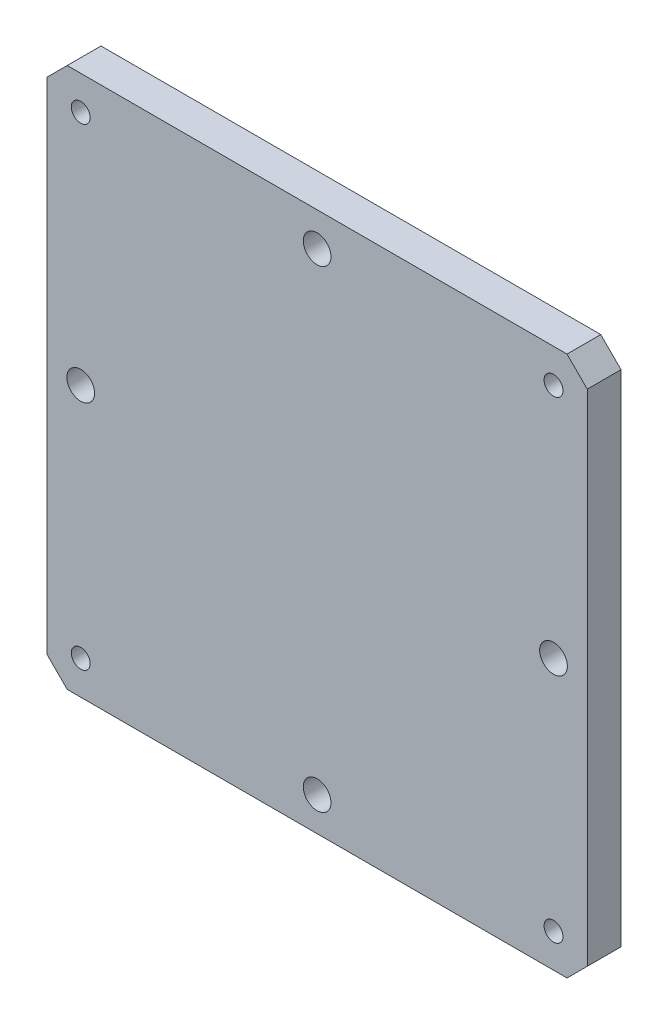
ISO-10303-21;
HEADER;
FILE_DESCRIPTION(('STEP AP214'),'2;1');
FILE_NAME('part.step','',(''),(''),'','','');
FILE_SCHEMA(('AUTOMOTIVE_DESIGN { 1 0 10303 214 1 1 1 1 }'));
ENDSEC;
DATA;
#1=APPLICATION_CONTEXT('core data for automotive mechanical design processes');
#2=APPLICATION_PROTOCOL_DEFINITION('international standard','automotive_design',2000,#1);
#3=PRODUCT_CONTEXT('',#1,'mechanical');
#4=PRODUCT('Part','Part','',(#3));
#5=PRODUCT_RELATED_PRODUCT_CATEGORY('part','',(#4));
#6=PRODUCT_DEFINITION_FORMATION('','',#4);
#7=PRODUCT_DEFINITION_CONTEXT('part definition',#1,'design');
#8=PRODUCT_DEFINITION('design','',#6,#7);
#9=PRODUCT_DEFINITION_SHAPE('','',#8);
#10=(LENGTH_UNIT() NAMED_UNIT(*) SI_UNIT(.MILLI.,.METRE.));
#11=(NAMED_UNIT(*) PLANE_ANGLE_UNIT() SI_UNIT($,.RADIAN.));
#12=(NAMED_UNIT(*) SI_UNIT($,.STERADIAN.) SOLID_ANGLE_UNIT());
#13=UNCERTAINTY_MEASURE_WITH_UNIT(LENGTH_MEASURE(1.E-05),#10,'distance_accuracy_value','');
#14=(GEOMETRIC_REPRESENTATION_CONTEXT(3) GLOBAL_UNCERTAINTY_ASSIGNED_CONTEXT((#13)) GLOBAL_UNIT_ASSIGNED_CONTEXT((#10,
#11,#12)) REPRESENTATION_CONTEXT('',''));
#15=CARTESIAN_POINT('',(0.,0.,0.));
#16=DIRECTION('',(0.,0.,1.));
#17=DIRECTION('',(1.,0.,0.));
#18=AXIS2_PLACEMENT_3D('',#15,#16,#17);
#19=CARTESIAN_POINT('',(3.88578058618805E-13,-3.88578058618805E-13,24.9999999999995));
#20=DIRECTION('',(1.,0.,0.));
#21=DIRECTION('',(0.,0.,-1.));
#22=AXIS2_PLACEMENT_3D('',#19,#20,#21);
#23=PLANE('',#22);
#24=DIRECTION('',(0.,-1.,0.));
#25=VECTOR('',#24,1.);
#26=CARTESIAN_POINT('',(0.,0.,0.));
#27=LINE('',#26,#25);
#28=CARTESIAN_POINT('',(9.99200722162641E-13,385.000000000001,2.22044604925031E-13));
#29=VERTEX_POINT('',#28);
#30=CARTESIAN_POINT('',(5.27355936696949E-13,15.0000000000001,0.));
#31=VERTEX_POINT('',#30);
#32=EDGE_CURVE('E135',#29,#31,#27,.T.);
#33=ORIENTED_EDGE('',*,*,#32,.T.);
#34=DIRECTION('',(0.,0.,1.));
#35=VECTOR('',#34,1.);
#36=CARTESIAN_POINT('',(1.58206781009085E-12,15.0000000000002,24.999999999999));
#37=LINE('',#36,#35);
#38=CARTESIAN_POINT('',(1.58206781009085E-12,15.0000000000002,24.999999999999));
#39=VERTEX_POINT('',#38);
#40=EDGE_CURVE('E181',#31,#39,#37,.T.);
#41=ORIENTED_EDGE('',*,*,#40,.T.);
#42=DIRECTION('',(0.,-1.,0.));
#43=VECTOR('',#42,1.);
#44=CARTESIAN_POINT('',(3.88578058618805E-13,-3.88578058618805E-13,24.9999999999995));
#45=LINE('',#44,#43);
#46=CARTESIAN_POINT('',(7.7715611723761E-13,385.000000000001,24.9999999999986));
#47=VERTEX_POINT('',#46);
#48=EDGE_CURVE('E133',#47,#39,#45,.T.);
#49=ORIENTED_EDGE('',*,*,#48,.F.);
#50=DIRECTION('',(0.,0.,-1.));
#51=VECTOR('',#50,1.);
#52=CARTESIAN_POINT('',(7.7715611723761E-13,385.000000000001,24.9999999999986));
#53=LINE('',#52,#51);
#54=EDGE_CURVE('E178',#47,#29,#53,.T.);
#55=ORIENTED_EDGE('',*,*,#54,.T.);
#56=EDGE_LOOP('',(#33,#41,#49,#55));
#57=FACE_BOUND('',#56,.T.);
#58=ADVANCED_FACE('F38',(#57),#23,.F.);
#59=CARTESIAN_POINT('',(3.88578058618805E-13,-3.88578058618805E-13,24.9999999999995));
#60=DIRECTION('',(0.,1.,0.));
#61=DIRECTION('',(0.,0.,1.));
#62=AXIS2_PLACEMENT_3D('',#59,#60,#61);
#63=PLANE('',#62);
#64=DIRECTION('',(1.,0.,0.));
#65=VECTOR('',#64,1.);
#66=CARTESIAN_POINT('',(0.,0.,0.));
#67=LINE('',#66,#65);
#68=CARTESIAN_POINT('',(15.0000000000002,0.,0.));
#69=VERTEX_POINT('',#68);
#70=CARTESIAN_POINT('',(385.000000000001,-2.22044604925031E-13,-4.44089209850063E-13));
#71=VERTEX_POINT('',#70);
#72=EDGE_CURVE('E131',#69,#71,#67,.T.);
#73=ORIENTED_EDGE('',*,*,#72,.T.);
#74=DIRECTION('',(0.,0.,1.));
#75=VECTOR('',#74,1.);
#76=CARTESIAN_POINT('',(385.000000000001,-4.44089209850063E-13,24.9999999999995));
#77=LINE('',#76,#75);
#78=CARTESIAN_POINT('',(385.000000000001,-4.44089209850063E-13,24.9999999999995));
#79=VERTEX_POINT('',#78);
#80=EDGE_CURVE('E109',#71,#79,#77,.T.);
#81=ORIENTED_EDGE('',*,*,#80,.T.);
#82=DIRECTION('',(1.,0.,0.));
#83=VECTOR('',#82,1.);
#84=CARTESIAN_POINT('',(3.88578058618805E-13,-3.88578058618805E-13,24.9999999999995));
#85=LINE('',#84,#83);
#86=CARTESIAN_POINT('',(15.0000000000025,7.21644966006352E-13,24.9999999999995));
#87=VERTEX_POINT('',#86);
#88=EDGE_CURVE('E195',#87,#79,#85,.T.);
#89=ORIENTED_EDGE('',*,*,#88,.F.);
#90=DIRECTION('',(0.,0.,-1.));
#91=VECTOR('',#90,1.);
#92=CARTESIAN_POINT('',(15.0000000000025,7.21644966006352E-13,24.9999999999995));
#93=LINE('',#92,#91);
#94=EDGE_CURVE('E114',#87,#69,#93,.T.);
#95=ORIENTED_EDGE('',*,*,#94,.T.);
#96=EDGE_LOOP('',(#73,#81,#89,#95));
#97=FACE_BOUND('',#96,.T.);
#98=ADVANCED_FACE('F200',(#97),#63,.F.);
#99=CARTESIAN_POINT('',(400.,-2.22044604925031E-13,25.0000000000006));
#100=DIRECTION('',(-1.,0.,0.));
#101=DIRECTION('',(0.,0.,1.));
#102=AXIS2_PLACEMENT_3D('',#99,#100,#101);
#103=PLANE('',#102);
#104=DIRECTION('',(0.,1.,0.));
#105=VECTOR('',#104,1.);
#106=CARTESIAN_POINT('',(400.,-2.22044604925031E-13,25.0000000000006));
#107=LINE('',#106,#105);
#108=CARTESIAN_POINT('',(400.000000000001,14.9999999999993,24.9999999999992));
#109=VERTEX_POINT('',#108);
#110=CARTESIAN_POINT('',(400.000000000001,385.,24.9999999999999));
#111=VERTEX_POINT('',#110);
#112=EDGE_CURVE('E123',#109,#111,#107,.T.);
#113=ORIENTED_EDGE('',*,*,#112,.F.);
#114=DIRECTION('',(0.,0.,-1.));
#115=VECTOR('',#114,1.);
#116=CARTESIAN_POINT('',(400.000000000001,14.9999999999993,24.9999999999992));
#117=LINE('',#116,#115);
#118=CARTESIAN_POINT('',(400.000000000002,14.999999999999,-2.22044604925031E-12));
#119=VERTEX_POINT('',#118);
#120=EDGE_CURVE('E108',#109,#119,#117,.T.);
#121=ORIENTED_EDGE('',*,*,#120,.T.);
#122=DIRECTION('',(0.,1.,0.));
#123=VECTOR('',#122,1.);
#124=CARTESIAN_POINT('',(400.000000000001,-2.77555756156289E-13,0.));
#125=LINE('',#124,#123);
#126=CARTESIAN_POINT('',(400.000000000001,385.,6.66133814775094E-13));
#127=VERTEX_POINT('',#126);
#128=EDGE_CURVE('E121',#119,#127,#125,.T.);
#129=ORIENTED_EDGE('',*,*,#128,.T.);
#130=DIRECTION('',(0.,0.,1.));
#131=VECTOR('',#130,1.);
#132=CARTESIAN_POINT('',(400.000000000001,385.,24.9999999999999));
#133=LINE('',#132,#131);
#134=EDGE_CURVE('E125',#127,#111,#133,.T.);
#135=ORIENTED_EDGE('',*,*,#134,.T.);
#136=EDGE_LOOP('',(#113,#121,#129,#135));
#137=FACE_BOUND('',#136,.T.);
#138=ADVANCED_FACE('F120',(#137),#103,.F.);
#139=CARTESIAN_POINT('',(4.71844785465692E-13,400.,25.0000000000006));
#140=DIRECTION('',(0.,-1.,0.));
#141=DIRECTION('',(0.,0.,-1.));
#142=AXIS2_PLACEMENT_3D('',#139,#140,#141);
#143=PLANE('',#142);
#144=DIRECTION('',(-1.,0.,0.));
#145=VECTOR('',#144,1.);
#146=CARTESIAN_POINT('',(4.71844785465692E-13,400.,25.0000000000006));
#147=LINE('',#146,#145);
#148=CARTESIAN_POINT('',(385.000000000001,400.,25.0000000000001));
#149=VERTEX_POINT('',#148);
#150=CARTESIAN_POINT('',(15.0000000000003,400.,25.0000000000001));
#151=VERTEX_POINT('',#150);
#152=EDGE_CURVE('E143',#149,#151,#147,.T.);
#153=ORIENTED_EDGE('',*,*,#152,.F.);
#154=DIRECTION('',(0.,0.,-1.));
#155=VECTOR('',#154,1.);
#156=CARTESIAN_POINT('',(385.000000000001,400.,25.0000000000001));
#157=LINE('',#156,#155);
#158=CARTESIAN_POINT('',(385.000000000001,400.,2.22044604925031E-13));
#159=VERTEX_POINT('',#158);
#160=EDGE_CURVE('E11',#149,#159,#157,.T.);
#161=ORIENTED_EDGE('',*,*,#160,.T.);
#162=DIRECTION('',(-1.,0.,0.));
#163=VECTOR('',#162,1.);
#164=CARTESIAN_POINT('',(1.94289029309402E-13,400.,4.44089209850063E-13));
#165=LINE('',#164,#163);
#166=CARTESIAN_POINT('',(15.0000000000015,400.000000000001,-1.11022302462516E-12));
#167=VERTEX_POINT('',#166);
#168=EDGE_CURVE('E130',#159,#167,#165,.T.);
#169=ORIENTED_EDGE('',*,*,#168,.T.);
#170=DIRECTION('',(0.,0.,1.));
#171=VECTOR('',#170,1.);
#172=CARTESIAN_POINT('',(15.0000000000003,400.,25.0000000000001));
#173=LINE('',#172,#171);
#174=EDGE_CURVE('E46',#167,#151,#173,.T.);
#175=ORIENTED_EDGE('',*,*,#174,.T.);
#176=EDGE_LOOP('',(#153,#161,#169,#175));
#177=FACE_BOUND('',#176,.T.);
#178=ADVANCED_FACE('F287',(#177),#143,.F.);
#179=CARTESIAN_POINT('',(3.88578058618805E-13,-3.88578058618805E-13,24.9999999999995));
#180=DIRECTION('',(0.,0.,-1.));
#181=DIRECTION('',(-1.,0.,0.));
#182=AXIS2_PLACEMENT_3D('',#179,#180,#181);
#183=PLANE('',#182);
#184=CARTESIAN_POINT('',(200.,375.,24.9999999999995));
#185=DIRECTION('',(0.,0.,-1.));
#186=DIRECTION('',(-1.,0.,0.));
#187=AXIS2_PLACEMENT_3D('',#184,#185,#186);
#188=CIRCLE('',#187,10.25);
#189=CARTESIAN_POINT('',(189.75,375.,24.9999999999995));
#190=VERTEX_POINT('',#189);
#191=EDGE_CURVE('E217',#190,#190,#188,.T.);
#192=ORIENTED_EDGE('',*,*,#191,.T.);
#193=EDGE_LOOP('',(#192));
#194=FACE_BOUND('',#193,.T.);
#195=CARTESIAN_POINT('',(25.0000000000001,200.,25.0000000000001));
#196=DIRECTION('',(0.,0.,-1.));
#197=DIRECTION('',(-1.,0.,0.));
#198=AXIS2_PLACEMENT_3D('',#195,#196,#197);
#199=CIRCLE('',#198,10.25);
#200=CARTESIAN_POINT('',(14.7500000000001,200.,25.0000000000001));
#201=VERTEX_POINT('',#200);
#202=EDGE_CURVE('E233',#201,#201,#199,.T.);
#203=ORIENTED_EDGE('',*,*,#202,.T.);
#204=EDGE_LOOP('',(#203));
#205=FACE_BOUND('',#204,.T.);
#206=CARTESIAN_POINT('',(200.,24.9999999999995,24.9999999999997));
#207=DIRECTION('',(0.,0.,-1.));
#208=DIRECTION('',(-1.,0.,0.));
#209=AXIS2_PLACEMENT_3D('',#206,#207,#208);
#210=CIRCLE('',#209,10.25);
#211=CARTESIAN_POINT('',(189.75,24.9999999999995,24.9999999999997));
#212=VERTEX_POINT('',#211);
#213=EDGE_CURVE('E227',#212,#212,#210,.T.);
#214=ORIENTED_EDGE('',*,*,#213,.T.);
#215=EDGE_LOOP('',(#214));
#216=FACE_BOUND('',#215,.T.);
#217=CARTESIAN_POINT('',(375.000000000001,200.,24.9999999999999));
#218=DIRECTION('',(0.,0.,-1.));
#219=DIRECTION('',(-1.,0.,0.));
#220=AXIS2_PLACEMENT_3D('',#217,#218,#219);
#221=CIRCLE('',#220,10.25);
#222=CARTESIAN_POINT('',(364.750000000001,200.,24.9999999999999));
#223=VERTEX_POINT('',#222);
#224=EDGE_CURVE('E221',#223,#223,#221,.T.);
#225=ORIENTED_EDGE('',*,*,#224,.T.);
#226=EDGE_LOOP('',(#225));
#227=FACE_BOUND('',#226,.T.);
#228=CARTESIAN_POINT('',(375.,375.000000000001,25.0000000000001));
#229=DIRECTION('',(0.,0.,-1.));
#230=DIRECTION('',(-1.,0.,0.));
#231=AXIS2_PLACEMENT_3D('',#228,#229,#230);
#232=CIRCLE('',#231,7.00000000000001);
#233=CARTESIAN_POINT('',(368.000000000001,375.000000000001,25.0000000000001));
#234=VERTEX_POINT('',#233);
#235=EDGE_CURVE('E214',#234,#234,#232,.T.);
#236=ORIENTED_EDGE('',*,*,#235,.T.);
#237=EDGE_LOOP('',(#236));
#238=FACE_BOUND('',#237,.T.);
#239=CARTESIAN_POINT('',(25.0000000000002,375.,24.9999999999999));
#240=DIRECTION('',(0.,0.,-1.));
#241=DIRECTION('',(-1.,0.,0.));
#242=AXIS2_PLACEMENT_3D('',#239,#240,#241);
#243=CIRCLE('',#242,6.99999999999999);
#244=CARTESIAN_POINT('',(18.0000000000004,375.,24.9999999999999));
#245=VERTEX_POINT('',#244);
#246=EDGE_CURVE('E211',#245,#245,#243,.T.);
#247=ORIENTED_EDGE('',*,*,#246,.T.);
#248=EDGE_LOOP('',(#247));
#249=FACE_BOUND('',#248,.T.);
#250=CARTESIAN_POINT('',(25.0000000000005,24.9999999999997,25.0000000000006));
#251=DIRECTION('',(0.,0.,-1.));
#252=DIRECTION('',(-1.,0.,0.));
#253=AXIS2_PLACEMENT_3D('',#250,#251,#252);
#254=CIRCLE('',#253,6.99999999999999);
#255=CARTESIAN_POINT('',(18.0000000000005,24.9999999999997,25.0000000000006));
#256=VERTEX_POINT('',#255);
#257=EDGE_CURVE('E203',#256,#256,#254,.T.);
#258=ORIENTED_EDGE('',*,*,#257,.T.);
#259=EDGE_LOOP('',(#258));
#260=FACE_BOUND('',#259,.T.);
#261=CARTESIAN_POINT('',(375.000000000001,24.9999999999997,24.9999999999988));
#262=DIRECTION('',(0.,0.,-1.));
#263=DIRECTION('',(-1.,0.,0.));
#264=AXIS2_PLACEMENT_3D('',#261,#262,#263);
#265=CIRCLE('',#264,7.00000000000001);
#266=CARTESIAN_POINT('',(368.000000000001,24.9999999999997,24.9999999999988));
#267=VERTEX_POINT('',#266);
#268=EDGE_CURVE('E201',#267,#267,#265,.T.);
#269=ORIENTED_EDGE('',*,*,#268,.T.);
#270=EDGE_LOOP('',(#269));
#271=FACE_BOUND('',#270,.T.);
#272=ORIENTED_EDGE('',*,*,#88,.T.);
#273=DIRECTION('',(-0.707106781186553,-0.707106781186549,0.));
#274=VECTOR('',#273,1.);
#275=CARTESIAN_POINT('',(400.000000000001,14.9999999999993,24.9999999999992));
#276=LINE('',#275,#274);
#277=EDGE_CURVE('E176',#79,#109,#276,.F.);
#278=ORIENTED_EDGE('',*,*,#277,.T.);
#279=ORIENTED_EDGE('',*,*,#112,.T.);
#280=DIRECTION('',(0.707106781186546,-0.707106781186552,0.));
#281=VECTOR('',#280,1.);
#282=CARTESIAN_POINT('',(385.000000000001,400.,25.0000000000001));
#283=LINE('',#282,#281);
#284=EDGE_CURVE('E59',#111,#149,#283,.F.);
#285=ORIENTED_EDGE('',*,*,#284,.T.);
#286=ORIENTED_EDGE('',*,*,#152,.T.);
#287=DIRECTION('',(0.707106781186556,0.707106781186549,0.));
#288=VECTOR('',#287,1.);
#289=CARTESIAN_POINT('',(7.7715611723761E-13,385.000000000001,24.9999999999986));
#290=LINE('',#289,#288);
#291=EDGE_CURVE('E171',#151,#47,#290,.F.);
#292=ORIENTED_EDGE('',*,*,#291,.T.);
#293=ORIENTED_EDGE('',*,*,#48,.T.);
#294=DIRECTION('',(-0.707106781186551,0.707106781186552,0.));
#295=VECTOR('',#294,1.);
#296=CARTESIAN_POINT('',(15.0000000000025,7.21644966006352E-13,24.9999999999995));
#297=LINE('',#296,#295);
#298=EDGE_CURVE('E174',#39,#87,#297,.F.);
#299=ORIENTED_EDGE('',*,*,#298,.T.);
#300=EDGE_LOOP('',(#272,#278,#279,#285,#286,#292,#293,#299));
#301=FACE_BOUND('',#300,.T.);
#302=ADVANCED_FACE('F192',(#194,#205,#216,#227,#238,#249,#260,#271,#301),#183,.F.);
#303=CARTESIAN_POINT('',(0.,0.,0.));
#304=DIRECTION('',(0.,0.,-1.));
#305=DIRECTION('',(-1.,0.,0.));
#306=AXIS2_PLACEMENT_3D('',#303,#304,#305);
#307=PLANE('',#306);
#308=CARTESIAN_POINT('',(200.000000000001,375.,-4.44089209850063E-13));
#309=DIRECTION('',(0.,0.,-1.));
#310=DIRECTION('',(-1.,0.,0.));
#311=AXIS2_PLACEMENT_3D('',#308,#309,#310);
#312=CIRCLE('',#311,10.25);
#313=CARTESIAN_POINT('',(189.75,375.,-4.44089209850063E-13));
#314=VERTEX_POINT('',#313);
#315=EDGE_CURVE('E236',#314,#314,#312,.T.);
#316=ORIENTED_EDGE('',*,*,#315,.F.);
#317=EDGE_LOOP('',(#316));
#318=FACE_BOUND('',#317,.T.);
#319=CARTESIAN_POINT('',(25.0000000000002,200.000000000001,2.22044604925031E-13));
#320=DIRECTION('',(0.,0.,-1.));
#321=DIRECTION('',(-1.,0.,0.));
#322=AXIS2_PLACEMENT_3D('',#319,#320,#321);
#323=CIRCLE('',#322,10.25);
#324=CARTESIAN_POINT('',(14.7500000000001,200.,2.22044604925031E-13));
#325=VERTEX_POINT('',#324);
#326=EDGE_CURVE('E230',#325,#325,#323,.T.);
#327=ORIENTED_EDGE('',*,*,#326,.F.);
#328=EDGE_LOOP('',(#327));
#329=FACE_BOUND('',#328,.T.);
#330=CARTESIAN_POINT('',(200.000000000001,25.,2.22044604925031E-13));
#331=DIRECTION('',(0.,0.,-1.));
#332=DIRECTION('',(-1.,0.,0.));
#333=AXIS2_PLACEMENT_3D('',#330,#331,#332);
#334=CIRCLE('',#333,10.25);
#335=CARTESIAN_POINT('',(189.75,24.9999999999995,2.22044604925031E-13));
#336=VERTEX_POINT('',#335);
#337=EDGE_CURVE('E224',#336,#336,#334,.T.);
#338=ORIENTED_EDGE('',*,*,#337,.F.);
#339=EDGE_LOOP('',(#338));
#340=FACE_BOUND('',#339,.T.);
#341=CARTESIAN_POINT('',(375.,200.,0.));
#342=DIRECTION('',(0.,0.,-1.));
#343=DIRECTION('',(-1.,0.,0.));
#344=AXIS2_PLACEMENT_3D('',#341,#342,#343);
#345=CIRCLE('',#344,10.25);
#346=CARTESIAN_POINT('',(364.750000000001,200.,0.));
#347=VERTEX_POINT('',#346);
#348=EDGE_CURVE('E218',#347,#347,#345,.T.);
#349=ORIENTED_EDGE('',*,*,#348,.F.);
#350=EDGE_LOOP('',(#349));
#351=FACE_BOUND('',#350,.T.);
#352=CARTESIAN_POINT('',(375.000000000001,24.9999999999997,-1.11022302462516E-12));
#353=DIRECTION('',(0.,0.,-1.));
#354=DIRECTION('',(-1.,0.,0.));
#355=AXIS2_PLACEMENT_3D('',#352,#353,#354);
#356=CIRCLE('',#355,9.00000000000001);
#357=CARTESIAN_POINT('',(366.000000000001,24.9999999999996,-1.11109038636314E-12));
#358=VERTEX_POINT('',#357);
#359=EDGE_CURVE('E152',#358,#358,#356,.F.);
#360=ORIENTED_EDGE('',*,*,#359,.T.);
#361=EDGE_LOOP('',(#360));
#362=FACE_BOUND('',#361,.T.);
#363=CARTESIAN_POINT('',(25.0000000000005,24.9999999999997,-2.22044604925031E-13));
#364=DIRECTION('',(0.,0.,-1.));
#365=DIRECTION('',(-1.,0.,0.));
#366=AXIS2_PLACEMENT_3D('',#363,#364,#365);
#367=CIRCLE('',#366,9.00000000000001);
#368=CARTESIAN_POINT('',(16.0000000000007,25.,-2.2291196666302E-13));
#369=VERTEX_POINT('',#368);
#370=EDGE_CURVE('E149',#369,#369,#367,.F.);
#371=ORIENTED_EDGE('',*,*,#370,.T.);
#372=EDGE_LOOP('',(#371));
#373=FACE_BOUND('',#372,.T.);
#374=CARTESIAN_POINT('',(25.0000000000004,375.,4.44089209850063E-13));
#375=DIRECTION('',(0.,0.,-1.));
#376=DIRECTION('',(-1.,0.,0.));
#377=AXIS2_PLACEMENT_3D('',#374,#375,#376);
#378=CIRCLE('',#377,9.00000000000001);
#379=CARTESIAN_POINT('',(16.0000000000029,375.,4.43221848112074E-13));
#380=VERTEX_POINT('',#379);
#381=EDGE_CURVE('E146',#380,#380,#378,.F.);
#382=ORIENTED_EDGE('',*,*,#381,.T.);
#383=EDGE_LOOP('',(#382));
#384=FACE_BOUND('',#383,.T.);
#385=CARTESIAN_POINT('',(375.000000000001,375.000000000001,2.22044604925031E-13));
#386=DIRECTION('',(0.,0.,-1.));
#387=DIRECTION('',(-1.,0.,0.));
#388=AXIS2_PLACEMENT_3D('',#385,#386,#387);
#389=CIRCLE('',#388,9.00000000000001);
#390=CARTESIAN_POINT('',(366.000000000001,375.,2.21177243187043E-13));
#391=VERTEX_POINT('',#390);
#392=EDGE_CURVE('E142',#391,#391,#389,.F.);
#393=ORIENTED_EDGE('',*,*,#392,.T.);
#394=EDGE_LOOP('',(#393));
#395=FACE_BOUND('',#394,.T.);
#396=ORIENTED_EDGE('',*,*,#128,.F.);
#397=DIRECTION('',(0.707106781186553,0.707106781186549,0.));
#398=VECTOR('',#397,1.);
#399=CARTESIAN_POINT('',(192.5,-192.5,0.));
#400=LINE('',#399,#398);
#401=EDGE_CURVE('E104',#119,#71,#400,.F.);
#402=ORIENTED_EDGE('',*,*,#401,.T.);
#403=ORIENTED_EDGE('',*,*,#72,.F.);
#404=DIRECTION('',(0.707106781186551,-0.707106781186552,0.));
#405=VECTOR('',#404,1.);
#406=CARTESIAN_POINT('',(7.50000000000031,7.4999999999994,-1.33226762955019E-12));
#407=LINE('',#406,#405);
#408=EDGE_CURVE('E115',#69,#31,#407,.F.);
#409=ORIENTED_EDGE('',*,*,#408,.T.);
#410=ORIENTED_EDGE('',*,*,#32,.F.);
#411=DIRECTION('',(-0.707106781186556,-0.707106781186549,0.));
#412=VECTOR('',#411,1.);
#413=CARTESIAN_POINT('',(-192.5,192.500000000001,-4.44089209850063E-13));
#414=LINE('',#413,#412);
#415=EDGE_CURVE('E124',#29,#167,#414,.F.);
#416=ORIENTED_EDGE('',*,*,#415,.T.);
#417=ORIENTED_EDGE('',*,*,#168,.F.);
#418=DIRECTION('',(-0.707106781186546,0.707106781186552,0.));
#419=VECTOR('',#418,1.);
#420=CARTESIAN_POINT('',(392.500000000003,392.499999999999,-2.22044604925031E-12));
#421=LINE('',#420,#419);
#422=EDGE_CURVE('E129',#159,#127,#421,.F.);
#423=ORIENTED_EDGE('',*,*,#422,.T.);
#424=EDGE_LOOP('',(#396,#402,#403,#409,#410,#416,#417,#423));
#425=FACE_BOUND('',#424,.T.);
#426=ADVANCED_FACE('F127',(#318,#329,#340,#351,#362,#373,#384,#395,#425),#307,.T.);
#427=CARTESIAN_POINT('',(375.000000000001,24.9999999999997,-1.11022302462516E-12));
#428=DIRECTION('',(0.,0.,-1.));
#429=DIRECTION('',(-1.,0.,0.));
#430=AXIS2_PLACEMENT_3D('',#427,#428,#429);
#431=CYLINDRICAL_SURFACE('',#430,7.00000000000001);
#432=CARTESIAN_POINT('',(375.000000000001,24.9999999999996,1.99999999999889));
#433=DIRECTION('',(0.,0.,-1.));
#434=DIRECTION('',(-1.,0.,0.));
#435=AXIS2_PLACEMENT_3D('',#432,#433,#434);
#436=CIRCLE('',#435,7.00000000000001);
#437=CARTESIAN_POINT('',(368.000000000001,24.9999999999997,1.99999999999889));
#438=VERTEX_POINT('',#437);
#439=EDGE_CURVE('E139',#438,#438,#436,.T.);
#440=CARTESIAN_POINT('',(368.000000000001,24.9999999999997,1.99999999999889));
#441=CARTESIAN_POINT('',(368.000000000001,24.9999999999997,2.23958333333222));
#442=CARTESIAN_POINT('',(368.000000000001,24.9999999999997,2.47916666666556));
#443=CARTESIAN_POINT('',(368.000000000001,24.9999999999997,2.95833333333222));
#444=CARTESIAN_POINT('',(368.000000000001,24.9999999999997,3.19791666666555));
#445=CARTESIAN_POINT('',(368.000000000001,24.9999999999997,3.67708333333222));
#446=CARTESIAN_POINT('',(368.000000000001,24.9999999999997,3.91666666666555));
#447=CARTESIAN_POINT('',(368.000000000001,24.9999999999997,4.39583333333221));
#448=CARTESIAN_POINT('',(368.000000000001,24.9999999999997,4.63541666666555));
#449=CARTESIAN_POINT('',(368.000000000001,24.9999999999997,5.11458333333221));
#450=CARTESIAN_POINT('',(368.000000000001,24.9999999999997,5.35416666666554));
#451=CARTESIAN_POINT('',(368.000000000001,24.9999999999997,5.83333333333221));
#452=CARTESIAN_POINT('',(368.000000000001,24.9999999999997,6.07291666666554));
#453=CARTESIAN_POINT('',(368.000000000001,24.9999999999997,6.55208333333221));
#454=CARTESIAN_POINT('',(368.000000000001,24.9999999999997,6.79166666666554));
#455=CARTESIAN_POINT('',(368.000000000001,24.9999999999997,7.2708333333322));
#456=CARTESIAN_POINT('',(368.000000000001,24.9999999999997,7.51041666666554));
#457=CARTESIAN_POINT('',(368.000000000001,24.9999999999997,7.9895833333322));
#458=CARTESIAN_POINT('',(368.000000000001,24.9999999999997,8.22916666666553));
#459=CARTESIAN_POINT('',(368.000000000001,24.9999999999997,8.7083333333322));
#460=CARTESIAN_POINT('',(368.000000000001,24.9999999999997,8.94791666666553));
#461=CARTESIAN_POINT('',(368.000000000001,24.9999999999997,9.4270833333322));
#462=CARTESIAN_POINT('',(368.000000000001,24.9999999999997,9.66666666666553));
#463=CARTESIAN_POINT('',(368.000000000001,24.9999999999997,10.1458333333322));
#464=CARTESIAN_POINT('',(368.000000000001,24.9999999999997,10.3854166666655));
#465=CARTESIAN_POINT('',(368.000000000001,24.9999999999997,10.8645833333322));
#466=CARTESIAN_POINT('',(368.000000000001,24.9999999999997,11.1041666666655));
#467=CARTESIAN_POINT('',(368.000000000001,24.9999999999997,11.5833333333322));
#468=CARTESIAN_POINT('',(368.000000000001,24.9999999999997,11.8229166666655));
#469=CARTESIAN_POINT('',(368.000000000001,24.9999999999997,12.3020833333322));
#470=CARTESIAN_POINT('',(368.000000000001,24.9999999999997,12.5416666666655));
#471=CARTESIAN_POINT('',(368.000000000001,24.9999999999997,13.0208333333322));
#472=CARTESIAN_POINT('',(368.000000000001,24.9999999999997,13.2604166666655));
#473=CARTESIAN_POINT('',(368.000000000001,24.9999999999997,13.7395833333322));
#474=CARTESIAN_POINT('',(368.000000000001,24.9999999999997,13.9791666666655));
#475=CARTESIAN_POINT('',(368.000000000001,24.9999999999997,14.4583333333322));
#476=CARTESIAN_POINT('',(368.000000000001,24.9999999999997,14.6979166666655));
#477=CARTESIAN_POINT('',(368.000000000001,24.9999999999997,15.1770833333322));
#478=CARTESIAN_POINT('',(368.000000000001,24.9999999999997,15.4166666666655));
#479=CARTESIAN_POINT('',(368.000000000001,24.9999999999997,15.8958333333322));
#480=CARTESIAN_POINT('',(368.000000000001,24.9999999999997,16.1354166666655));
#481=CARTESIAN_POINT('',(368.000000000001,24.9999999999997,16.6145833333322));
#482=CARTESIAN_POINT('',(368.000000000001,24.9999999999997,16.8541666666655));
#483=CARTESIAN_POINT('',(368.000000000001,24.9999999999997,17.3333333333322));
#484=CARTESIAN_POINT('',(368.000000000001,24.9999999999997,17.5729166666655));
#485=CARTESIAN_POINT('',(368.000000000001,24.9999999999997,18.0520833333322));
#486=CARTESIAN_POINT('',(368.000000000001,24.9999999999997,18.2916666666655));
#487=CARTESIAN_POINT('',(368.000000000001,24.9999999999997,18.7708333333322));
#488=CARTESIAN_POINT('',(368.000000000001,24.9999999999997,19.0104166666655));
#489=CARTESIAN_POINT('',(368.000000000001,24.9999999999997,19.4895833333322));
#490=CARTESIAN_POINT('',(368.000000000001,24.9999999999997,19.7291666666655));
#491=CARTESIAN_POINT('',(368.000000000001,24.9999999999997,20.2083333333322));
#492=CARTESIAN_POINT('',(368.000000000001,24.9999999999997,20.4479166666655));
#493=CARTESIAN_POINT('',(368.000000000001,24.9999999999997,20.9270833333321));
#494=CARTESIAN_POINT('',(368.000000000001,24.9999999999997,21.1666666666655));
#495=CARTESIAN_POINT('',(368.000000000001,24.9999999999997,21.6458333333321));
#496=CARTESIAN_POINT('',(368.000000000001,24.9999999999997,21.8854166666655));
#497=CARTESIAN_POINT('',(368.000000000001,24.9999999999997,22.3645833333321));
#498=CARTESIAN_POINT('',(368.000000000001,24.9999999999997,22.6041666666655));
#499=CARTESIAN_POINT('',(368.000000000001,24.9999999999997,23.0833333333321));
#500=CARTESIAN_POINT('',(368.000000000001,24.9999999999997,23.3229166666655));
#501=CARTESIAN_POINT('',(368.000000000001,24.9999999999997,23.8020833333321));
#502=CARTESIAN_POINT('',(368.000000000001,24.9999999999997,24.0416666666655));
#503=CARTESIAN_POINT('',(368.000000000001,24.9999999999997,24.5208333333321));
#504=CARTESIAN_POINT('',(368.000000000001,24.9999999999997,24.7604166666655));
#505=CARTESIAN_POINT('',(368.000000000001,24.9999999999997,24.9999999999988));
#506=B_SPLINE_CURVE_WITH_KNOTS('',3,(#440,#441,#442,#443,#444,#445,#446,#447,#448,#449,#450,
#451,#452,#453,#454,#455,#456,#457,#458,#459,#460,#461,#462,#463,#464,#465,#466,#467,#468,#469,
#470,#471,#472,#473,#474,#475,#476,#477,#478,#479,#480,#481,#482,#483,#484,#485,#486,#487,#488,
#489,#490,#491,#492,#493,#494,#495,#496,#497,#498,#499,#500,#501,#502,#503,#504,#505),
.UNSPECIFIED.,.F.,.F.,(4,2,2,2,2,2,2,2,2,2,2,2,2,2,2,2,2,2,2,2,2,2,2,2,2,2,2,2,2,2,2,2,4),(0.,
0.718749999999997,1.43749999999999,2.15624999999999,2.87499999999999,3.59374999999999,
4.31249999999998,5.03124999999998,5.74999999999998,6.46874999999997,7.18749999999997,
7.90624999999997,8.62499999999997,9.34374999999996,10.0625,10.78125,11.5,12.21875,
12.9374999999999,13.6562499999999,14.3749999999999,15.0937499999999,15.8124999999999,
16.5312499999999,17.2499999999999,17.9687499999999,18.6874999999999,19.4062499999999,
20.1249999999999,20.8437499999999,21.5624999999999,22.2812499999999,22.9999999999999),.UNSPECIFIED.);
#507=EDGE_CURVE('BSEAM253',#438,#267,#506,.T.);
#508=ORIENTED_EDGE('',*,*,#439,.T.);
#509=ORIENTED_EDGE('',*,*,#268,.F.);
#510=ORIENTED_EDGE('',*,*,#507,.T.);
#511=ORIENTED_EDGE('',*,*,#507,.F.);
#512=EDGE_LOOP('',(#508,#510,#509,#511));
#513=FACE_BOUND('',#512,.T.);
#514=ADVANCED_FACE('F253',(#513),#431,.F.);
#515=CARTESIAN_POINT('',(25.0000000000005,24.9999999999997,-2.22044604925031E-13));
#516=DIRECTION('',(0.,0.,-1.));
#517=DIRECTION('',(-1.,0.,0.));
#518=AXIS2_PLACEMENT_3D('',#515,#516,#517);
#519=CYLINDRICAL_SURFACE('',#518,6.99999999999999);
#520=CARTESIAN_POINT('',(25.0000000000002,25.,1.99999999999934));
#521=DIRECTION('',(0.,0.,-1.));
#522=DIRECTION('',(-1.,0.,0.));
#523=AXIS2_PLACEMENT_3D('',#520,#521,#522);
#524=CIRCLE('',#523,6.99999999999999);
#525=CARTESIAN_POINT('',(18.0000000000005,24.9999999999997,1.99999999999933));
#526=VERTEX_POINT('',#525);
#527=EDGE_CURVE('E155',#526,#526,#524,.T.);
#528=CARTESIAN_POINT('',(18.0000000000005,24.9999999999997,1.99999999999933));
#529=CARTESIAN_POINT('',(18.0000000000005,24.9999999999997,2.23958333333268));
#530=CARTESIAN_POINT('',(18.0000000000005,24.9999999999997,2.47916666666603));
#531=CARTESIAN_POINT('',(18.0000000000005,24.9999999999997,2.95833333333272));
#532=CARTESIAN_POINT('',(18.0000000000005,24.9999999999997,3.19791666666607));
#533=CARTESIAN_POINT('',(18.0000000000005,24.9999999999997,3.67708333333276));
#534=CARTESIAN_POINT('',(18.0000000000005,24.9999999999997,3.91666666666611));
#535=CARTESIAN_POINT('',(18.0000000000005,24.9999999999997,4.3958333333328));
#536=CARTESIAN_POINT('',(18.0000000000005,24.9999999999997,4.63541666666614));
#537=CARTESIAN_POINT('',(18.0000000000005,24.9999999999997,5.11458333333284));
#538=CARTESIAN_POINT('',(18.0000000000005,24.9999999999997,5.35416666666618));
#539=CARTESIAN_POINT('',(18.0000000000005,24.9999999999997,5.83333333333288));
#540=CARTESIAN_POINT('',(18.0000000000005,24.9999999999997,6.07291666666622));
#541=CARTESIAN_POINT('',(18.0000000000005,24.9999999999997,6.55208333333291));
#542=CARTESIAN_POINT('',(18.0000000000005,24.9999999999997,6.79166666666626));
#543=CARTESIAN_POINT('',(18.0000000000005,24.9999999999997,7.27083333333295));
#544=CARTESIAN_POINT('',(18.0000000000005,24.9999999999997,7.5104166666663));
#545=CARTESIAN_POINT('',(18.0000000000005,24.9999999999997,7.98958333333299));
#546=CARTESIAN_POINT('',(18.0000000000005,24.9999999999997,8.22916666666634));
#547=CARTESIAN_POINT('',(18.0000000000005,24.9999999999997,8.70833333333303));
#548=CARTESIAN_POINT('',(18.0000000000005,24.9999999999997,8.94791666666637));
#549=CARTESIAN_POINT('',(18.0000000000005,24.9999999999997,9.42708333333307));
#550=CARTESIAN_POINT('',(18.0000000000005,24.9999999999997,9.66666666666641));
#551=CARTESIAN_POINT('',(18.0000000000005,24.9999999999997,10.1458333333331));
#552=CARTESIAN_POINT('',(18.0000000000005,24.9999999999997,10.3854166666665));
#553=CARTESIAN_POINT('',(18.0000000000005,24.9999999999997,10.8645833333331));
#554=CARTESIAN_POINT('',(18.0000000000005,24.9999999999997,11.1041666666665));
#555=CARTESIAN_POINT('',(18.0000000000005,24.9999999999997,11.5833333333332));
#556=CARTESIAN_POINT('',(18.0000000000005,24.9999999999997,11.8229166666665));
#557=CARTESIAN_POINT('',(18.0000000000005,24.9999999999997,12.3020833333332));
#558=CARTESIAN_POINT('',(18.0000000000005,24.9999999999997,12.5416666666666));
#559=CARTESIAN_POINT('',(18.0000000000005,24.9999999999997,13.0208333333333));
#560=CARTESIAN_POINT('',(18.0000000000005,24.9999999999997,13.2604166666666));
#561=CARTESIAN_POINT('',(18.0000000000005,24.9999999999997,13.7395833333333));
#562=CARTESIAN_POINT('',(18.0000000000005,24.9999999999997,13.9791666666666));
#563=CARTESIAN_POINT('',(18.0000000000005,24.9999999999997,14.4583333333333));
#564=CARTESIAN_POINT('',(18.0000000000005,24.9999999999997,14.6979166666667));
#565=CARTESIAN_POINT('',(18.0000000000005,24.9999999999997,15.1770833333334));
#566=CARTESIAN_POINT('',(18.0000000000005,24.9999999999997,15.4166666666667));
#567=CARTESIAN_POINT('',(18.0000000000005,24.9999999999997,15.8958333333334));
#568=CARTESIAN_POINT('',(18.0000000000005,24.9999999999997,16.1354166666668));
#569=CARTESIAN_POINT('',(18.0000000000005,24.9999999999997,16.6145833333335));
#570=CARTESIAN_POINT('',(18.0000000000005,24.9999999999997,16.8541666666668));
#571=CARTESIAN_POINT('',(18.0000000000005,24.9999999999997,17.3333333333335));
#572=CARTESIAN_POINT('',(18.0000000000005,24.9999999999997,17.5729166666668));
#573=CARTESIAN_POINT('',(18.0000000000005,24.9999999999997,18.0520833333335));
#574=CARTESIAN_POINT('',(18.0000000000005,24.9999999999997,18.2916666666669));
#575=CARTESIAN_POINT('',(18.0000000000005,24.9999999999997,18.7708333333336));
#576=CARTESIAN_POINT('',(18.0000000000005,24.9999999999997,19.0104166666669));
#577=CARTESIAN_POINT('',(18.0000000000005,24.9999999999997,19.4895833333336));
#578=CARTESIAN_POINT('',(18.0000000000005,24.9999999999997,19.729166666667));
#579=CARTESIAN_POINT('',(18.0000000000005,24.9999999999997,20.2083333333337));
#580=CARTESIAN_POINT('',(18.0000000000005,24.9999999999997,20.447916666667));
#581=CARTESIAN_POINT('',(18.0000000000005,24.9999999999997,20.9270833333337));
#582=CARTESIAN_POINT('',(18.0000000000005,24.9999999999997,21.166666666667));
#583=CARTESIAN_POINT('',(18.0000000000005,24.9999999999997,21.6458333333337));
#584=CARTESIAN_POINT('',(18.0000000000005,24.9999999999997,21.8854166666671));
#585=CARTESIAN_POINT('',(18.0000000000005,24.9999999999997,22.3645833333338));
#586=CARTESIAN_POINT('',(18.0000000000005,24.9999999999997,22.6041666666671));
#587=CARTESIAN_POINT('',(18.0000000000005,24.9999999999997,23.0833333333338));
#588=CARTESIAN_POINT('',(18.0000000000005,24.9999999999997,23.3229166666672));
#589=CARTESIAN_POINT('',(18.0000000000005,24.9999999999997,23.8020833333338));
#590=CARTESIAN_POINT('',(18.0000000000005,24.9999999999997,24.0416666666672));
#591=CARTESIAN_POINT('',(18.0000000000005,24.9999999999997,24.5208333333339));
#592=CARTESIAN_POINT('',(18.0000000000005,24.9999999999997,24.7604166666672));
#593=CARTESIAN_POINT('',(18.0000000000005,24.9999999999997,25.0000000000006));
#594=B_SPLINE_CURVE_WITH_KNOTS('',3,(#528,#529,#530,#531,#532,#533,#534,#535,#536,#537,#538,
#539,#540,#541,#542,#543,#544,#545,#546,#547,#548,#549,#550,#551,#552,#553,#554,#555,#556,#557,
#558,#559,#560,#561,#562,#563,#564,#565,#566,#567,#568,#569,#570,#571,#572,#573,#574,#575,#576,
#577,#578,#579,#580,#581,#582,#583,#584,#585,#586,#587,#588,#589,#590,#591,#592,#593),
.UNSPECIFIED.,.F.,.F.,(4,2,2,2,2,2,2,2,2,2,2,2,2,2,2,2,2,2,2,2,2,2,2,2,2,2,2,2,2,2,2,2,4),(0.,
0.718750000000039,1.43750000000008,2.15625000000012,2.87500000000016,3.59375000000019,
4.31250000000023,5.03125000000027,5.75000000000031,6.46875000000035,7.18750000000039,
7.90625000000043,8.62500000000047,9.34375000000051,10.0625000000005,10.7812500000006,
11.5000000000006,12.2187500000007,12.9375000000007,13.6562500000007,14.3750000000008,
15.0937500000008,15.8125000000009,16.5312500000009,17.2500000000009,17.968750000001,
18.687500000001,19.4062500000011,20.1250000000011,20.8437500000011,21.5625000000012,
22.2812500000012,23.0000000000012),.UNSPECIFIED.);
#595=EDGE_CURVE('BSEAM296',#526,#256,#594,.T.);
#596=ORIENTED_EDGE('',*,*,#527,.T.);
#597=ORIENTED_EDGE('',*,*,#257,.F.);
#598=ORIENTED_EDGE('',*,*,#595,.T.);
#599=ORIENTED_EDGE('',*,*,#595,.F.);
#600=EDGE_LOOP('',(#596,#598,#597,#599));
#601=FACE_BOUND('',#600,.T.);
#602=ADVANCED_FACE('F296',(#601),#519,.F.);
#603=CARTESIAN_POINT('',(25.0000000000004,375.,4.44089209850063E-13));
#604=DIRECTION('',(0.,0.,-1.));
#605=DIRECTION('',(-1.,0.,0.));
#606=AXIS2_PLACEMENT_3D('',#603,#604,#605);
#607=CYLINDRICAL_SURFACE('',#606,6.99999999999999);
#608=CARTESIAN_POINT('',(25.0000000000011,375.,1.99999999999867));
#609=DIRECTION('',(0.,0.,-1.));
#610=DIRECTION('',(-1.,0.,0.));
#611=AXIS2_PLACEMENT_3D('',#608,#609,#610);
#612=CIRCLE('',#611,6.99999999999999);
#613=CARTESIAN_POINT('',(18.0000000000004,375.,1.99999999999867));
#614=VERTEX_POINT('',#613);
#615=EDGE_CURVE('E158',#614,#614,#612,.T.);
#616=CARTESIAN_POINT('',(18.0000000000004,375.,1.99999999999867));
#617=CARTESIAN_POINT('',(18.0000000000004,375.,2.23958333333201));
#618=CARTESIAN_POINT('',(18.0000000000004,375.,2.47916666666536));
#619=CARTESIAN_POINT('',(18.0000000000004,375.,2.95833333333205));
#620=CARTESIAN_POINT('',(18.0000000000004,375.,3.1979166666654));
#621=CARTESIAN_POINT('',(18.0000000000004,375.,3.67708333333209));
#622=CARTESIAN_POINT('',(18.0000000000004,375.,3.91666666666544));
#623=CARTESIAN_POINT('',(18.0000000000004,375.,4.39583333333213));
#624=CARTESIAN_POINT('',(18.0000000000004,375.,4.63541666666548));
#625=CARTESIAN_POINT('',(18.0000000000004,375.,5.11458333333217));
#626=CARTESIAN_POINT('',(18.0000000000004,375.,5.35416666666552));
#627=CARTESIAN_POINT('',(18.0000000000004,375.,5.83333333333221));
#628=CARTESIAN_POINT('',(18.0000000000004,375.,6.07291666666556));
#629=CARTESIAN_POINT('',(18.0000000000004,375.,6.55208333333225));
#630=CARTESIAN_POINT('',(18.0000000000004,375.,6.79166666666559));
#631=CARTESIAN_POINT('',(18.0000000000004,375.,7.27083333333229));
#632=CARTESIAN_POINT('',(18.0000000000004,375.,7.51041666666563));
#633=CARTESIAN_POINT('',(18.0000000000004,375.,7.98958333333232));
#634=CARTESIAN_POINT('',(18.0000000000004,375.,8.22916666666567));
#635=CARTESIAN_POINT('',(18.0000000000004,375.,8.70833333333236));
#636=CARTESIAN_POINT('',(18.0000000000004,375.,8.94791666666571));
#637=CARTESIAN_POINT('',(18.0000000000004,375.,9.4270833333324));
#638=CARTESIAN_POINT('',(18.0000000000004,375.,9.66666666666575));
#639=CARTESIAN_POINT('',(18.0000000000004,375.,10.1458333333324));
#640=CARTESIAN_POINT('',(18.0000000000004,375.,10.3854166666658));
#641=CARTESIAN_POINT('',(18.0000000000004,375.,10.8645833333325));
#642=CARTESIAN_POINT('',(18.0000000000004,375.,11.1041666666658));
#643=CARTESIAN_POINT('',(18.0000000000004,375.,11.5833333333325));
#644=CARTESIAN_POINT('',(18.0000000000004,375.,11.8229166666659));
#645=CARTESIAN_POINT('',(18.0000000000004,375.,12.3020833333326));
#646=CARTESIAN_POINT('',(18.0000000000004,375.,12.5416666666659));
#647=CARTESIAN_POINT('',(18.0000000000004,375.,13.0208333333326));
#648=CARTESIAN_POINT('',(18.0000000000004,375.,13.2604166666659));
#649=CARTESIAN_POINT('',(18.0000000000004,375.,13.7395833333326));
#650=CARTESIAN_POINT('',(18.0000000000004,375.,13.979166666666));
#651=CARTESIAN_POINT('',(18.0000000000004,375.,14.4583333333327));
#652=CARTESIAN_POINT('',(18.0000000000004,375.,14.697916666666));
#653=CARTESIAN_POINT('',(18.0000000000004,375.,15.1770833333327));
#654=CARTESIAN_POINT('',(18.0000000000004,375.,15.4166666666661));
#655=CARTESIAN_POINT('',(18.0000000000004,375.,15.8958333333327));
#656=CARTESIAN_POINT('',(18.0000000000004,375.,16.1354166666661));
#657=CARTESIAN_POINT('',(18.0000000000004,375.,16.6145833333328));
#658=CARTESIAN_POINT('',(18.0000000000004,375.,16.8541666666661));
#659=CARTESIAN_POINT('',(18.0000000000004,375.,17.3333333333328));
#660=CARTESIAN_POINT('',(18.0000000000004,375.,17.5729166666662));
#661=CARTESIAN_POINT('',(18.0000000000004,375.,18.0520833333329));
#662=CARTESIAN_POINT('',(18.0000000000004,375.,18.2916666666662));
#663=CARTESIAN_POINT('',(18.0000000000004,375.,18.7708333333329));
#664=CARTESIAN_POINT('',(18.0000000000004,375.,19.0104166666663));
#665=CARTESIAN_POINT('',(18.0000000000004,375.,19.4895833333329));
#666=CARTESIAN_POINT('',(18.0000000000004,375.,19.7291666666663));
#667=CARTESIAN_POINT('',(18.0000000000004,375.,20.208333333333));
#668=CARTESIAN_POINT('',(18.0000000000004,375.,20.4479166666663));
#669=CARTESIAN_POINT('',(18.0000000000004,375.,20.927083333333));
#670=CARTESIAN_POINT('',(18.0000000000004,375.,21.1666666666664));
#671=CARTESIAN_POINT('',(18.0000000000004,375.,21.6458333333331));
#672=CARTESIAN_POINT('',(18.0000000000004,375.,21.8854166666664));
#673=CARTESIAN_POINT('',(18.0000000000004,375.,22.3645833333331));
#674=CARTESIAN_POINT('',(18.0000000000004,375.,22.6041666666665));
#675=CARTESIAN_POINT('',(18.0000000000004,375.,23.0833333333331));
#676=CARTESIAN_POINT('',(18.0000000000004,375.,23.3229166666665));
#677=CARTESIAN_POINT('',(18.0000000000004,375.,23.8020833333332));
#678=CARTESIAN_POINT('',(18.0000000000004,375.,24.0416666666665));
#679=CARTESIAN_POINT('',(18.0000000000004,375.,24.5208333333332));
#680=CARTESIAN_POINT('',(18.0000000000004,375.,24.7604166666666));
#681=CARTESIAN_POINT('',(18.0000000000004,375.,24.9999999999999));
#682=B_SPLINE_CURVE_WITH_KNOTS('',3,(#616,#617,#618,#619,#620,#621,#622,#623,#624,#625,#626,
#627,#628,#629,#630,#631,#632,#633,#634,#635,#636,#637,#638,#639,#640,#641,#642,#643,#644,#645,
#646,#647,#648,#649,#650,#651,#652,#653,#654,#655,#656,#657,#658,#659,#660,#661,#662,#663,#664,
#665,#666,#667,#668,#669,#670,#671,#672,#673,#674,#675,#676,#677,#678,#679,#680,#681),
.UNSPECIFIED.,.F.,.F.,(4,2,2,2,2,2,2,2,2,2,2,2,2,2,2,2,2,2,2,2,2,2,2,2,2,2,2,2,2,2,2,2,4),(0.,
0.718750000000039,1.43750000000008,2.15625000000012,2.87500000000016,3.59375000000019,
4.31250000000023,5.03125000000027,5.75000000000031,6.46875000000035,7.18750000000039,
7.90625000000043,8.62500000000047,9.34375000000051,10.0625000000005,10.7812500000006,
11.5000000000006,12.2187500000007,12.9375000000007,13.6562500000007,14.3750000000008,
15.0937500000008,15.8125000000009,16.5312500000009,17.2500000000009,17.968750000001,
18.687500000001,19.4062500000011,20.1250000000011,20.8437500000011,21.5625000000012,
22.2812500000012,23.0000000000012),.UNSPECIFIED.);
#683=EDGE_CURVE('BSEAM281',#614,#245,#682,.T.);
#684=ORIENTED_EDGE('',*,*,#615,.T.);
#685=ORIENTED_EDGE('',*,*,#246,.F.);
#686=ORIENTED_EDGE('',*,*,#683,.T.);
#687=ORIENTED_EDGE('',*,*,#683,.F.);
#688=EDGE_LOOP('',(#684,#686,#685,#687));
#689=FACE_BOUND('',#688,.T.);
#690=ADVANCED_FACE('F281',(#689),#607,.F.);
#691=CARTESIAN_POINT('',(375.000000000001,375.000000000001,2.22044604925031E-13));
#692=DIRECTION('',(0.,0.,-1.));
#693=DIRECTION('',(-1.,0.,0.));
#694=AXIS2_PLACEMENT_3D('',#691,#692,#693);
#695=CYLINDRICAL_SURFACE('',#694,7.00000000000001);
#696=CARTESIAN_POINT('',(375.000000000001,375.,2.));
#697=DIRECTION('',(0.,0.,-1.));
#698=DIRECTION('',(-1.,0.,0.));
#699=AXIS2_PLACEMENT_3D('',#696,#697,#698);
#700=CIRCLE('',#699,7.00000000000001);
#701=CARTESIAN_POINT('',(368.000000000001,375.000000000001,2.));
#702=VERTEX_POINT('',#701);
#703=EDGE_CURVE('E161',#702,#702,#700,.T.);
#704=CARTESIAN_POINT('',(368.000000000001,375.000000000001,2.));
#705=CARTESIAN_POINT('',(368.000000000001,375.000000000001,2.23958333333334));
#706=CARTESIAN_POINT('',(368.000000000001,375.000000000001,2.47916666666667));
#707=CARTESIAN_POINT('',(368.000000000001,375.000000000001,2.95833333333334));
#708=CARTESIAN_POINT('',(368.000000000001,375.000000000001,3.19791666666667));
#709=CARTESIAN_POINT('',(368.000000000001,375.000000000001,3.67708333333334));
#710=CARTESIAN_POINT('',(368.000000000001,375.000000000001,3.91666666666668));
#711=CARTESIAN_POINT('',(368.000000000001,375.000000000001,4.39583333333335));
#712=CARTESIAN_POINT('',(368.000000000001,375.000000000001,4.63541666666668));
#713=CARTESIAN_POINT('',(368.000000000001,375.000000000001,5.11458333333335));
#714=CARTESIAN_POINT('',(368.000000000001,375.000000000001,5.35416666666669));
#715=CARTESIAN_POINT('',(368.000000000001,375.000000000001,5.83333333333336));
#716=CARTESIAN_POINT('',(368.000000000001,375.000000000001,6.07291666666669));
#717=CARTESIAN_POINT('',(368.000000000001,375.000000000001,6.55208333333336));
#718=CARTESIAN_POINT('',(368.000000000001,375.000000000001,6.7916666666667));
#719=CARTESIAN_POINT('',(368.000000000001,375.000000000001,7.27083333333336));
#720=CARTESIAN_POINT('',(368.000000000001,375.000000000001,7.5104166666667));
#721=CARTESIAN_POINT('',(368.000000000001,375.000000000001,7.98958333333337));
#722=CARTESIAN_POINT('',(368.000000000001,375.000000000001,8.2291666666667));
#723=CARTESIAN_POINT('',(368.000000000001,375.000000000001,8.70833333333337));
#724=CARTESIAN_POINT('',(368.000000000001,375.000000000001,8.94791666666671));
#725=CARTESIAN_POINT('',(368.000000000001,375.000000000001,9.42708333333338));
#726=CARTESIAN_POINT('',(368.000000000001,375.000000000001,9.66666666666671));
#727=CARTESIAN_POINT('',(368.000000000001,375.000000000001,10.1458333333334));
#728=CARTESIAN_POINT('',(368.000000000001,375.000000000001,10.3854166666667));
#729=CARTESIAN_POINT('',(368.000000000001,375.000000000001,10.8645833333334));
#730=CARTESIAN_POINT('',(368.000000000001,375.000000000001,11.1041666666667));
#731=CARTESIAN_POINT('',(368.000000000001,375.000000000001,11.5833333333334));
#732=CARTESIAN_POINT('',(368.000000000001,375.000000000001,11.8229166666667));
#733=CARTESIAN_POINT('',(368.000000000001,375.000000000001,12.3020833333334));
#734=CARTESIAN_POINT('',(368.000000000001,375.000000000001,12.5416666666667));
#735=CARTESIAN_POINT('',(368.000000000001,375.000000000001,13.0208333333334));
#736=CARTESIAN_POINT('',(368.000000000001,375.000000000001,13.2604166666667));
#737=CARTESIAN_POINT('',(368.000000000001,375.000000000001,13.7395833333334));
#738=CARTESIAN_POINT('',(368.000000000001,375.000000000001,13.9791666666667));
#739=CARTESIAN_POINT('',(368.000000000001,375.000000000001,14.4583333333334));
#740=CARTESIAN_POINT('',(368.000000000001,375.000000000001,14.6979166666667));
#741=CARTESIAN_POINT('',(368.000000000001,375.000000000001,15.1770833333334));
#742=CARTESIAN_POINT('',(368.000000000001,375.000000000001,15.4166666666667));
#743=CARTESIAN_POINT('',(368.000000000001,375.000000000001,15.8958333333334));
#744=CARTESIAN_POINT('',(368.000000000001,375.000000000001,16.1354166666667));
#745=CARTESIAN_POINT('',(368.000000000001,375.000000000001,16.6145833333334));
#746=CARTESIAN_POINT('',(368.000000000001,375.000000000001,16.8541666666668));
#747=CARTESIAN_POINT('',(368.000000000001,375.000000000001,17.3333333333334));
#748=CARTESIAN_POINT('',(368.000000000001,375.000000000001,17.5729166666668));
#749=CARTESIAN_POINT('',(368.000000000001,375.000000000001,18.0520833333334));
#750=CARTESIAN_POINT('',(368.000000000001,375.000000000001,18.2916666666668));
#751=CARTESIAN_POINT('',(368.000000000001,375.000000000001,18.7708333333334));
#752=CARTESIAN_POINT('',(368.000000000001,375.000000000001,19.0104166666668));
#753=CARTESIAN_POINT('',(368.000000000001,375.000000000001,19.4895833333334));
#754=CARTESIAN_POINT('',(368.000000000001,375.000000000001,19.7291666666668));
#755=CARTESIAN_POINT('',(368.000000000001,375.000000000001,20.2083333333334));
#756=CARTESIAN_POINT('',(368.000000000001,375.000000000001,20.4479166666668));
#757=CARTESIAN_POINT('',(368.000000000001,375.000000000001,20.9270833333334));
#758=CARTESIAN_POINT('',(368.000000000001,375.000000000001,21.1666666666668));
#759=CARTESIAN_POINT('',(368.000000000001,375.000000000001,21.6458333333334));
#760=CARTESIAN_POINT('',(368.000000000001,375.000000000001,21.8854166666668));
#761=CARTESIAN_POINT('',(368.000000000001,375.000000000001,22.3645833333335));
#762=CARTESIAN_POINT('',(368.000000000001,375.000000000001,22.6041666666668));
#763=CARTESIAN_POINT('',(368.000000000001,375.000000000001,23.0833333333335));
#764=CARTESIAN_POINT('',(368.000000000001,375.000000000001,23.3229166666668));
#765=CARTESIAN_POINT('',(368.000000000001,375.000000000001,23.8020833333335));
#766=CARTESIAN_POINT('',(368.000000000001,375.000000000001,24.0416666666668));
#767=CARTESIAN_POINT('',(368.000000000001,375.000000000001,24.5208333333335));
#768=CARTESIAN_POINT('',(368.000000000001,375.000000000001,24.7604166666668));
#769=CARTESIAN_POINT('',(368.000000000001,375.000000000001,25.0000000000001));
#770=B_SPLINE_CURVE_WITH_KNOTS('',3,(#704,#705,#706,#707,#708,#709,#710,#711,#712,#713,#714,
#715,#716,#717,#718,#719,#720,#721,#722,#723,#724,#725,#726,#727,#728,#729,#730,#731,#732,#733,
#734,#735,#736,#737,#738,#739,#740,#741,#742,#743,#744,#745,#746,#747,#748,#749,#750,#751,#752,
#753,#754,#755,#756,#757,#758,#759,#760,#761,#762,#763,#764,#765,#766,#767,#768,#769),
.UNSPECIFIED.,.F.,.F.,(4,2,2,2,2,2,2,2,2,2,2,2,2,2,2,2,2,2,2,2,2,2,2,2,2,2,2,2,2,2,2,2,4),(0.,
0.718750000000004,1.43750000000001,2.15625000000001,2.87500000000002,3.59375000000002,
4.31250000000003,5.03125000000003,5.75000000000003,6.46875000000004,7.18750000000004,
7.90625000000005,8.62500000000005,9.34375000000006,10.0625000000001,10.7812500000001,
11.5000000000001,12.2187500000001,12.9375000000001,13.6562500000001,14.3750000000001,
15.0937500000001,15.8125000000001,16.5312500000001,17.2500000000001,17.9687500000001,
18.6875000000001,19.4062500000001,20.1250000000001,20.8437500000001,21.5625000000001,
22.2812500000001,23.0000000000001),.UNSPECIFIED.);
#771=EDGE_CURVE('BSEAM277',#702,#234,#770,.T.);
#772=ORIENTED_EDGE('',*,*,#703,.T.);
#773=ORIENTED_EDGE('',*,*,#235,.F.);
#774=ORIENTED_EDGE('',*,*,#771,.T.);
#775=ORIENTED_EDGE('',*,*,#771,.F.);
#776=EDGE_LOOP('',(#772,#774,#773,#775));
#777=FACE_BOUND('',#776,.T.);
#778=ADVANCED_FACE('F277',(#777),#695,.F.);
#779=CARTESIAN_POINT('',(375.000000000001,24.9999999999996,1.99999999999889));
#780=DIRECTION('',(0.,0.,-1.));
#781=DIRECTION('',(-1.,0.,0.));
#782=AXIS2_PLACEMENT_3D('',#779,#780,#781);
#783=CONICAL_SURFACE('',#782,7.00000000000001,0.785398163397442);
#784=CARTESIAN_POINT('',(366.000000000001,24.9999999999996,-1.11109038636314E-12));
#785=CARTESIAN_POINT('',(366.020833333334,24.9999999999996,0.0208333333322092));
#786=CARTESIAN_POINT('',(366.041666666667,24.9999999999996,0.0416666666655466));
#787=CARTESIAN_POINT('',(366.083333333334,24.9999999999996,0.0833333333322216));
#788=CARTESIAN_POINT('',(366.104166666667,24.9999999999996,0.104166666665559));
#789=CARTESIAN_POINT('',(366.145833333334,24.9999999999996,0.145833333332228));
#790=CARTESIAN_POINT('',(366.166666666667,24.9999999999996,0.166666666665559));
#791=CARTESIAN_POINT('',(366.208333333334,24.9999999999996,0.208333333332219));
#792=CARTESIAN_POINT('',(366.229166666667,24.9999999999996,0.229166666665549));
#793=CARTESIAN_POINT('',(366.270833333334,24.9999999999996,0.27083333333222));
#794=CARTESIAN_POINT('',(366.291666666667,24.9999999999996,0.291666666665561));
#795=CARTESIAN_POINT('',(366.333333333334,24.9999999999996,0.333333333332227));
#796=CARTESIAN_POINT('',(366.354166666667,24.9999999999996,0.354166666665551));
#797=CARTESIAN_POINT('',(366.395833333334,24.9999999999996,0.395833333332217));
#798=CARTESIAN_POINT('',(366.416666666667,24.9999999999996,0.416666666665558));
#799=CARTESIAN_POINT('',(366.458333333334,24.9999999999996,0.458333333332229));
#800=CARTESIAN_POINT('',(366.479166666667,24.9999999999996,0.479166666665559));
#801=CARTESIAN_POINT('',(366.520833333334,24.9999999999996,0.520833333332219));
#802=CARTESIAN_POINT('',(366.541666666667,24.9999999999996,0.54166666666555));
#803=CARTESIAN_POINT('',(366.583333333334,24.9999999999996,0.583333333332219));
#804=CARTESIAN_POINT('',(366.604166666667,24.9999999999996,0.604166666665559));
#805=CARTESIAN_POINT('',(366.645833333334,24.9999999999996,0.645833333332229));
#806=CARTESIAN_POINT('',(366.666666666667,24.9999999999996,0.666666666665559));
#807=CARTESIAN_POINT('',(366.708333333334,24.9999999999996,0.70833333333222));
#808=CARTESIAN_POINT('',(366.729166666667,24.9999999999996,0.72916666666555));
#809=CARTESIAN_POINT('',(366.770833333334,24.9999999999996,0.77083333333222));
#810=CARTESIAN_POINT('',(366.791666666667,24.9999999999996,0.791666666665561));
#811=CARTESIAN_POINT('',(366.833333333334,24.9999999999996,0.833333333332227));
#812=CARTESIAN_POINT('',(366.854166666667,24.9999999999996,0.854166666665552));
#813=CARTESIAN_POINT('',(366.895833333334,24.9999999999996,0.895833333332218));
#814=CARTESIAN_POINT('',(366.916666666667,24.9999999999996,0.916666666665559));
#815=CARTESIAN_POINT('',(366.958333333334,24.9999999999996,0.95833333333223));
#816=CARTESIAN_POINT('',(366.979166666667,24.9999999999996,0.97916666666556));
#817=CARTESIAN_POINT('',(367.020833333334,24.9999999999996,1.02083333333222));
#818=CARTESIAN_POINT('',(367.041666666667,24.9999999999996,1.04166666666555));
#819=CARTESIAN_POINT('',(367.083333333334,24.9999999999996,1.08333333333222));
#820=CARTESIAN_POINT('',(367.104166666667,24.9999999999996,1.10416666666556));
#821=CARTESIAN_POINT('',(367.145833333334,24.9999999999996,1.14583333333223));
#822=CARTESIAN_POINT('',(367.166666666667,24.9999999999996,1.16666666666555));
#823=CARTESIAN_POINT('',(367.208333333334,24.9999999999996,1.20833333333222));
#824=CARTESIAN_POINT('',(367.229166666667,24.9999999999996,1.22916666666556));
#825=CARTESIAN_POINT('',(367.270833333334,24.9999999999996,1.27083333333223));
#826=CARTESIAN_POINT('',(367.291666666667,24.9999999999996,1.29166666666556));
#827=CARTESIAN_POINT('',(367.333333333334,24.9999999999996,1.33333333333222));
#828=CARTESIAN_POINT('',(367.354166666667,24.9999999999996,1.35416666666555));
#829=CARTESIAN_POINT('',(367.395833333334,24.9999999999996,1.39583333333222));
#830=CARTESIAN_POINT('',(367.416666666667,24.9999999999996,1.41666666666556));
#831=CARTESIAN_POINT('',(367.458333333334,24.9999999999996,1.45833333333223));
#832=CARTESIAN_POINT('',(367.479166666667,24.9999999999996,1.47916666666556));
#833=CARTESIAN_POINT('',(367.520833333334,24.9999999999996,1.52083333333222));
#834=CARTESIAN_POINT('',(367.541666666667,24.9999999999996,1.54166666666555));
#835=CARTESIAN_POINT('',(367.583333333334,24.9999999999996,1.58333333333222));
#836=CARTESIAN_POINT('',(367.604166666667,24.9999999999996,1.60416666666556));
#837=CARTESIAN_POINT('',(367.645833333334,24.9999999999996,1.64583333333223));
#838=CARTESIAN_POINT('',(367.666666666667,24.9999999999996,1.66666666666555));
#839=CARTESIAN_POINT('',(367.708333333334,24.9999999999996,1.70833333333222));
#840=CARTESIAN_POINT('',(367.729166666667,24.9999999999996,1.72916666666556));
#841=CARTESIAN_POINT('',(367.770833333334,24.9999999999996,1.77083333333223));
#842=CARTESIAN_POINT('',(367.791666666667,24.9999999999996,1.79166666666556));
#843=CARTESIAN_POINT('',(367.833333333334,24.9999999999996,1.83333333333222));
#844=CARTESIAN_POINT('',(367.854166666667,24.9999999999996,1.85416666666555));
#845=CARTESIAN_POINT('',(367.895833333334,24.9999999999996,1.89583333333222));
#846=CARTESIAN_POINT('',(367.916666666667,24.9999999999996,1.91666666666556));
#847=CARTESIAN_POINT('',(367.958333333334,24.9999999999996,1.95833333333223));
#848=CARTESIAN_POINT('',(367.979166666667,24.9999999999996,1.97916666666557));
#849=CARTESIAN_POINT('',(368.000000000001,24.9999999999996,1.99999999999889));
#850=B_SPLINE_CURVE_WITH_KNOTS('',3,(#784,#785,#786,#787,#788,#789,#790,#791,#792,#793,#794,
#795,#796,#797,#798,#799,#800,#801,#802,#803,#804,#805,#806,#807,#808,#809,#810,#811,#812,#813,
#814,#815,#816,#817,#818,#819,#820,#821,#822,#823,#824,#825,#826,#827,#828,#829,#830,#831,#832,
#833,#834,#835,#836,#837,#838,#839,#840,#841,#842,#843,#844,#845,#846,#847,#848,#849),
.UNSPECIFIED.,.F.,.F.,(4,2,2,2,2,2,2,2,2,2,2,2,2,2,2,2,2,2,2,2,2,2,2,2,2,2,2,2,2,2,2,2,4),(0.,
0.0883883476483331,0.176776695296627,0.26516504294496,0.353553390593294,0.441941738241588,
0.530330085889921,0.618718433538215,0.707106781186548,0.795495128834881,0.883883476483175,
0.972271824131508,1.06066017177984,1.14904851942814,1.23743686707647,1.32582521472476,
1.4142135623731,1.50260191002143,1.59099025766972,1.67937860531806,1.76776695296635,
1.85615530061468,1.94454364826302,2.03293199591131,2.12132034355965,2.20970869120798,
2.29809703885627,2.38648538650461,2.4748737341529,2.56326208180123,2.65165042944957,
2.74003877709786,2.82842712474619),.UNSPECIFIED.);
#851=EDGE_CURVE('BSEAM280',#358,#438,#850,.T.);
#852=ORIENTED_EDGE('',*,*,#359,.F.);
#853=ORIENTED_EDGE('',*,*,#439,.F.);
#854=ORIENTED_EDGE('',*,*,#851,.T.);
#855=ORIENTED_EDGE('',*,*,#851,.F.);
#856=EDGE_LOOP('',(#852,#854,#853,#855));
#857=FACE_BOUND('',#856,.T.);
#858=ADVANCED_FACE('F280',(#857),#783,.F.);
#859=CARTESIAN_POINT('',(25.0000000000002,25.,1.99999999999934));
#860=DIRECTION('',(0.,0.,-1.));
#861=DIRECTION('',(-1.,0.,0.));
#862=AXIS2_PLACEMENT_3D('',#859,#860,#861);
#863=CONICAL_SURFACE('',#862,6.99999999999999,0.785398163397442);
#864=CARTESIAN_POINT('',(16.0000000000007,25.,-2.2291196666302E-13));
#865=CARTESIAN_POINT('',(16.020833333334,25.,0.0208333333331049));
#866=CARTESIAN_POINT('',(16.0416666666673,25.,0.0416666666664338));
#867=CARTESIAN_POINT('',(16.083333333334,25.,0.0833333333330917));
#868=CARTESIAN_POINT('',(16.1041666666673,25.,0.104166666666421));
#869=CARTESIAN_POINT('',(16.145833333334,25.,0.145833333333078));
#870=CARTESIAN_POINT('',(16.1666666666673,25.,0.166666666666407));
#871=CARTESIAN_POINT('',(16.208333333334,25.,0.208333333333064));
#872=CARTESIAN_POINT('',(16.2291666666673,25.,0.229166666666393));
#873=CARTESIAN_POINT('',(16.270833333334,25.,0.27083333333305));
#874=CARTESIAN_POINT('',(16.2916666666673,25.,0.291666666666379));
#875=CARTESIAN_POINT('',(16.3333333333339,25.,0.333333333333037));
#876=CARTESIAN_POINT('',(16.3541666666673,25.,0.354166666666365));
#877=CARTESIAN_POINT('',(16.3958333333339,25.,0.395833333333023));
#878=CARTESIAN_POINT('',(16.4166666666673,25.,0.416666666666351));
#879=CARTESIAN_POINT('',(16.4583333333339,25.,0.458333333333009));
#880=CARTESIAN_POINT('',(16.4791666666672,25.,0.479166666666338));
#881=CARTESIAN_POINT('',(16.5208333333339,25.,0.520833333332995));
#882=CARTESIAN_POINT('',(16.5416666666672,25.,0.541666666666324));
#883=CARTESIAN_POINT('',(16.5833333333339,25.,0.583333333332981));
#884=CARTESIAN_POINT('',(16.6041666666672,25.,0.60416666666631));
#885=CARTESIAN_POINT('',(16.6458333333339,25.,0.645833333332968));
#886=CARTESIAN_POINT('',(16.6666666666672,25.,0.666666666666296));
#887=CARTESIAN_POINT('',(16.7083333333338,25.,0.708333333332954));
#888=CARTESIAN_POINT('',(16.7291666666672,25.,0.729166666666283));
#889=CARTESIAN_POINT('',(16.7708333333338,25.,0.77083333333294));
#890=CARTESIAN_POINT('',(16.7916666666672,25.,0.791666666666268));
#891=CARTESIAN_POINT('',(16.8333333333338,25.,0.833333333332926));
#892=CARTESIAN_POINT('',(16.8541666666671,25.,0.854166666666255));
#893=CARTESIAN_POINT('',(16.8958333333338,25.,0.895833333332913));
#894=CARTESIAN_POINT('',(16.9166666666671,25.,0.916666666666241));
#895=CARTESIAN_POINT('',(16.9583333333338,25.,0.958333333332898));
#896=CARTESIAN_POINT('',(16.9791666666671,25.,0.979166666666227));
#897=CARTESIAN_POINT('',(17.0208333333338,25.,1.02083333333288));
#898=CARTESIAN_POINT('',(17.0416666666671,25.,1.04166666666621));
#899=CARTESIAN_POINT('',(17.0833333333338,25.,1.08333333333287));
#900=CARTESIAN_POINT('',(17.1041666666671,25.,1.1041666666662));
#901=CARTESIAN_POINT('',(17.1458333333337,25.,1.14583333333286));
#902=CARTESIAN_POINT('',(17.1666666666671,25.,1.16666666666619));
#903=CARTESIAN_POINT('',(17.2083333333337,25.,1.20833333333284));
#904=CARTESIAN_POINT('',(17.2291666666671,25.,1.22916666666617));
#905=CARTESIAN_POINT('',(17.2708333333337,25.,1.27083333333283));
#906=CARTESIAN_POINT('',(17.291666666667,25.,1.29166666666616));
#907=CARTESIAN_POINT('',(17.3333333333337,25.,1.33333333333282));
#908=CARTESIAN_POINT('',(17.354166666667,25.,1.35416666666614));
#909=CARTESIAN_POINT('',(17.3958333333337,25.,1.3958333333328));
#910=CARTESIAN_POINT('',(17.416666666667,25.,1.41666666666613));
#911=CARTESIAN_POINT('',(17.4583333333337,25.,1.45833333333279));
#912=CARTESIAN_POINT('',(17.479166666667,25.,1.47916666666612));
#913=CARTESIAN_POINT('',(17.5208333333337,25.,1.52083333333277));
#914=CARTESIAN_POINT('',(17.541666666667,25.,1.5416666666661));
#915=CARTESIAN_POINT('',(17.5833333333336,25.,1.58333333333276));
#916=CARTESIAN_POINT('',(17.604166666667,25.,1.60416666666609));
#917=CARTESIAN_POINT('',(17.6458333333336,25.,1.64583333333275));
#918=CARTESIAN_POINT('',(17.666666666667,25.,1.66666666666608));
#919=CARTESIAN_POINT('',(17.7083333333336,25.,1.70833333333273));
#920=CARTESIAN_POINT('',(17.7291666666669,25.,1.72916666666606));
#921=CARTESIAN_POINT('',(17.7708333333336,25.,1.77083333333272));
#922=CARTESIAN_POINT('',(17.7916666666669,25.,1.79166666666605));
#923=CARTESIAN_POINT('',(17.8333333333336,25.,1.83333333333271));
#924=CARTESIAN_POINT('',(17.8541666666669,25.,1.85416666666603));
#925=CARTESIAN_POINT('',(17.8958333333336,25.,1.89583333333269));
#926=CARTESIAN_POINT('',(17.9166666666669,25.,1.91666666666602));
#927=CARTESIAN_POINT('',(17.9583333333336,25.,1.95833333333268));
#928=CARTESIAN_POINT('',(17.9791666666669,25.,1.97916666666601));
#929=CARTESIAN_POINT('',(18.0000000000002,25.,1.99999999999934));
#930=B_SPLINE_CURVE_WITH_KNOTS('',3,(#864,#865,#866,#867,#868,#869,#870,#871,#872,#873,#874,
#875,#876,#877,#878,#879,#880,#881,#882,#883,#884,#885,#886,#887,#888,#889,#890,#891,#892,#893,
#894,#895,#896,#897,#898,#899,#900,#901,#902,#903,#904,#905,#906,#907,#908,#909,#910,#911,#912,
#913,#914,#915,#916,#917,#918,#919,#920,#921,#922,#923,#924,#925,#926,#927,#928,#929),
.UNSPECIFIED.,.F.,.F.,(4,2,2,2,2,2,2,2,2,2,2,2,2,2,2,2,2,2,2,2,2,2,2,2,2,2,2,2,2,2,2,2,4),(0.,
0.0883883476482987,0.176776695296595,0.265165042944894,0.353553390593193,0.44194173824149,
0.530330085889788,0.618718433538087,0.707106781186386,0.795495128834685,0.883883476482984,
0.972271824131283,1.06066017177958,1.14904851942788,1.23743686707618,1.32582521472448,
1.41421356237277,1.50260191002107,1.59099025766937,1.67937860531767,1.76776695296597,
1.85615530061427,1.94454364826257,2.03293199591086,2.12132034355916,2.20970869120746,
2.29809703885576,2.38648538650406,2.47487373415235,2.56326208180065,2.65165042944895,
2.74003877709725,2.82842712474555),.UNSPECIFIED.);
#931=EDGE_CURVE('BSEAM314',#369,#526,#930,.T.);
#932=ORIENTED_EDGE('',*,*,#370,.F.);
#933=ORIENTED_EDGE('',*,*,#527,.F.);
#934=ORIENTED_EDGE('',*,*,#931,.T.);
#935=ORIENTED_EDGE('',*,*,#931,.F.);
#936=EDGE_LOOP('',(#932,#934,#933,#935));
#937=FACE_BOUND('',#936,.T.);
#938=ADVANCED_FACE('F314',(#937),#863,.F.);
#939=CARTESIAN_POINT('',(25.0000000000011,375.,1.99999999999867));
#940=DIRECTION('',(0.,0.,-1.));
#941=DIRECTION('',(-1.,0.,0.));
#942=AXIS2_PLACEMENT_3D('',#939,#940,#941);
#943=CONICAL_SURFACE('',#942,6.99999999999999,0.785398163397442);
#944=CARTESIAN_POINT('',(16.0000000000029,375.,4.43221848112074E-13));
#945=CARTESIAN_POINT('',(16.0208333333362,375.,0.0208333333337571));
#946=CARTESIAN_POINT('',(16.0416666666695,375.,0.0416666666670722));
#947=CARTESIAN_POINT('',(16.0833333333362,375.,0.0833333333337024));
#948=CARTESIAN_POINT('',(16.1041666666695,375.,0.104166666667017));
#949=CARTESIAN_POINT('',(16.1458333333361,375.,0.145833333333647));
#950=CARTESIAN_POINT('',(16.1666666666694,375.,0.166666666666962));
#951=CARTESIAN_POINT('',(16.208333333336,375.,0.208333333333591));
#952=CARTESIAN_POINT('',(16.2291666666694,375.,0.229166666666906));
#953=CARTESIAN_POINT('',(16.270833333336,375.,0.270833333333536));
#954=CARTESIAN_POINT('',(16.2916666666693,375.,0.291666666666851));
#955=CARTESIAN_POINT('',(16.3333333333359,375.,0.333333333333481));
#956=CARTESIAN_POINT('',(16.3541666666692,375.,0.354166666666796));
#957=CARTESIAN_POINT('',(16.3958333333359,375.,0.395833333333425));
#958=CARTESIAN_POINT('',(16.4166666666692,375.,0.41666666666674));
#959=CARTESIAN_POINT('',(16.4583333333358,375.,0.45833333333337));
#960=CARTESIAN_POINT('',(16.4791666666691,375.,0.479166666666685));
#961=CARTESIAN_POINT('',(16.5208333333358,375.,0.520833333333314));
#962=CARTESIAN_POINT('',(16.5416666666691,375.,0.541666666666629));
#963=CARTESIAN_POINT('',(16.5833333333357,375.,0.583333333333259));
#964=CARTESIAN_POINT('',(16.604166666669,375.,0.604166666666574));
#965=CARTESIAN_POINT('',(16.6458333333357,375.,0.645833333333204));
#966=CARTESIAN_POINT('',(16.666666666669,375.,0.666666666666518));
#967=CARTESIAN_POINT('',(16.7083333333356,375.,0.708333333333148));
#968=CARTESIAN_POINT('',(16.7291666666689,375.,0.729166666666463));
#969=CARTESIAN_POINT('',(16.7708333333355,375.,0.770833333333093));
#970=CARTESIAN_POINT('',(16.7916666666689,375.,0.791666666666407));
#971=CARTESIAN_POINT('',(16.8333333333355,375.,0.833333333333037));
#972=CARTESIAN_POINT('',(16.8541666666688,375.,0.854166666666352));
#973=CARTESIAN_POINT('',(16.8958333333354,375.,0.895833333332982));
#974=CARTESIAN_POINT('',(16.9166666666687,375.,0.916666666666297));
#975=CARTESIAN_POINT('',(16.9583333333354,375.,0.958333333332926));
#976=CARTESIAN_POINT('',(16.9791666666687,375.,0.979166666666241));
#977=CARTESIAN_POINT('',(17.0208333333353,375.,1.02083333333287));
#978=CARTESIAN_POINT('',(17.0416666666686,375.,1.04166666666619));
#979=CARTESIAN_POINT('',(17.0833333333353,375.,1.08333333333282));
#980=CARTESIAN_POINT('',(17.1041666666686,375.,1.10416666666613));
#981=CARTESIAN_POINT('',(17.1458333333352,375.,1.14583333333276));
#982=CARTESIAN_POINT('',(17.1666666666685,375.,1.16666666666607));
#983=CARTESIAN_POINT('',(17.2083333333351,375.,1.2083333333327));
#984=CARTESIAN_POINT('',(17.2291666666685,375.,1.22916666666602));
#985=CARTESIAN_POINT('',(17.2708333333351,375.,1.27083333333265));
#986=CARTESIAN_POINT('',(17.2916666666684,375.,1.29166666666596));
#987=CARTESIAN_POINT('',(17.333333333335,375.,1.33333333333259));
#988=CARTESIAN_POINT('',(17.3541666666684,375.,1.35416666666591));
#989=CARTESIAN_POINT('',(17.395833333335,375.,1.39583333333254));
#990=CARTESIAN_POINT('',(17.4166666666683,375.,1.41666666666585));
#991=CARTESIAN_POINT('',(17.4583333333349,375.,1.45833333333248));
#992=CARTESIAN_POINT('',(17.4791666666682,375.,1.4791666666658));
#993=CARTESIAN_POINT('',(17.5208333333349,375.,1.52083333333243));
#994=CARTESIAN_POINT('',(17.5416666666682,375.,1.54166666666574));
#995=CARTESIAN_POINT('',(17.5833333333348,375.,1.58333333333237));
#996=CARTESIAN_POINT('',(17.6041666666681,375.,1.60416666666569));
#997=CARTESIAN_POINT('',(17.6458333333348,375.,1.64583333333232));
#998=CARTESIAN_POINT('',(17.6666666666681,375.,1.66666666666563));
#999=CARTESIAN_POINT('',(17.7083333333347,375.,1.70833333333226));
#1000=CARTESIAN_POINT('',(17.729166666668,375.,1.72916666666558));
#1001=CARTESIAN_POINT('',(17.7708333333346,375.,1.77083333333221));
#1002=CARTESIAN_POINT('',(17.791666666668,375.,1.79166666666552));
#1003=CARTESIAN_POINT('',(17.8333333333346,375.,1.83333333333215));
#1004=CARTESIAN_POINT('',(17.8541666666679,375.,1.85416666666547));
#1005=CARTESIAN_POINT('',(17.8958333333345,375.,1.89583333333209));
#1006=CARTESIAN_POINT('',(17.9166666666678,375.,1.91666666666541));
#1007=CARTESIAN_POINT('',(17.9583333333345,375.,1.95833333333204));
#1008=CARTESIAN_POINT('',(17.9791666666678,375.,1.97916666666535));
#1009=CARTESIAN_POINT('',(18.0000000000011,375.,1.99999999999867));
#1010=B_SPLINE_CURVE_WITH_KNOTS('',3,(#944,#945,#946,#947,#948,#949,#950,#951,#952,#953,#954,
#955,#956,#957,#958,#959,#960,#961,#962,#963,#964,#965,#966,#967,#968,#969,#970,#971,#972,#973,
#974,#975,#976,#977,#978,#979,#980,#981,#982,#983,#984,#985,#986,#987,#988,#989,#990,#991,#992,
#993,#994,#995,#996,#997,#998,#999,#1000,#1001,#1002,#1003,#1004,#1005,#1006,#1007,#1008,#1009),
.UNSPECIFIED.,.F.,.F.,(4,2,2,2,2,2,2,2,2,2,2,2,2,2,2,2,2,2,2,2,2,2,2,2,2,2,2,2,2,2,2,2,4),(0.,
0.0883883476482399,0.176776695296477,0.265165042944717,0.353553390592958,0.441941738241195,
0.530330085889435,0.618718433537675,0.707106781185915,0.795495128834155,0.883883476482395,
0.972271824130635,1.06066017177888,1.14904851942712,1.23743686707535,1.32582521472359,
1.41421356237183,1.50260191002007,1.59099025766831,1.67937860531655,1.76776695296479,
1.85615530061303,1.94454364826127,2.03293199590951,2.12132034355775,2.20970869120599,
2.29809703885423,2.38648538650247,2.47487373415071,2.56326208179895,2.65165042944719,
2.74003877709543,2.82842712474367),.UNSPECIFIED.);
#1011=EDGE_CURVE('BSEAM273',#380,#614,#1010,.T.);
#1012=ORIENTED_EDGE('',*,*,#381,.F.);
#1013=ORIENTED_EDGE('',*,*,#615,.F.);
#1014=ORIENTED_EDGE('',*,*,#1011,.T.);
#1015=ORIENTED_EDGE('',*,*,#1011,.F.);
#1016=EDGE_LOOP('',(#1012,#1014,#1013,#1015));
#1017=FACE_BOUND('',#1016,.T.);
#1018=ADVANCED_FACE('F273',(#1017),#943,.F.);
#1019=CARTESIAN_POINT('',(375.000000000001,375.,2.));
#1020=DIRECTION('',(0.,0.,-1.));
#1021=DIRECTION('',(-1.,0.,0.));
#1022=AXIS2_PLACEMENT_3D('',#1019,#1020,#1021);
#1023=CONICAL_SURFACE('',#1022,7.00000000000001,0.785398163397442);
#1024=CARTESIAN_POINT('',(366.000000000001,375.,2.21177243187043E-13));
#1025=CARTESIAN_POINT('',(366.020833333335,375.,0.0208333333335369));
#1026=CARTESIAN_POINT('',(366.041666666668,375.,0.0416666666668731));
#1027=CARTESIAN_POINT('',(366.083333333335,375.,0.0833333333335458));
#1028=CARTESIAN_POINT('',(366.104166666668,375.,0.104166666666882));
#1029=CARTESIAN_POINT('',(366.145833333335,375.,0.145833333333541));
#1030=CARTESIAN_POINT('',(366.166666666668,375.,0.166666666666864));
#1031=CARTESIAN_POINT('',(366.208333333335,375.,0.208333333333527));
#1032=CARTESIAN_POINT('',(366.229166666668,375.,0.229166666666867));
#1033=CARTESIAN_POINT('',(366.270833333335,375.,0.270833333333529));
#1034=CARTESIAN_POINT('',(366.291666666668,375.,0.291666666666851));
#1035=CARTESIAN_POINT('',(366.333333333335,375.,0.333333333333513));
#1036=CARTESIAN_POINT('',(366.354166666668,375.,0.354166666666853));
#1037=CARTESIAN_POINT('',(366.395833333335,375.,0.395833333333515));
#1038=CARTESIAN_POINT('',(366.416666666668,375.,0.416666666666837));
#1039=CARTESIAN_POINT('',(366.458333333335,375.,0.458333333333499));
#1040=CARTESIAN_POINT('',(366.479166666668,375.,0.479166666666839));
#1041=CARTESIAN_POINT('',(366.520833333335,375.,0.520833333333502));
#1042=CARTESIAN_POINT('',(366.541666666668,375.,0.541666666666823));
#1043=CARTESIAN_POINT('',(366.583333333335,375.,0.583333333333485));
#1044=CARTESIAN_POINT('',(366.604166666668,375.,0.604166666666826));
#1045=CARTESIAN_POINT('',(366.645833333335,375.,0.645833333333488));
#1046=CARTESIAN_POINT('',(366.666666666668,375.,0.66666666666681));
#1047=CARTESIAN_POINT('',(366.708333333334,375.,0.708333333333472));
#1048=CARTESIAN_POINT('',(366.729166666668,375.,0.729166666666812));
#1049=CARTESIAN_POINT('',(366.770833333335,375.,0.770833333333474));
#1050=CARTESIAN_POINT('',(366.791666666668,375.,0.791666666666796));
#1051=CARTESIAN_POINT('',(366.833333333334,375.,0.833333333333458));
#1052=CARTESIAN_POINT('',(366.854166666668,375.,0.854166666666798));
#1053=CARTESIAN_POINT('',(366.895833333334,375.,0.895833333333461));
#1054=CARTESIAN_POINT('',(366.916666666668,375.,0.916666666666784));
#1055=CARTESIAN_POINT('',(366.958333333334,375.,0.958333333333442));
#1056=CARTESIAN_POINT('',(366.979166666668,375.,0.979166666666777));
#1057=CARTESIAN_POINT('',(367.020833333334,375.,1.02083333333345));
#1058=CARTESIAN_POINT('',(367.041666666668,375.,1.04166666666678));
#1059=CARTESIAN_POINT('',(367.083333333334,375.,1.08333333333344));
#1060=CARTESIAN_POINT('',(367.104166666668,375.,1.10416666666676));
#1061=CARTESIAN_POINT('',(367.145833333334,375.,1.14583333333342));
#1062=CARTESIAN_POINT('',(367.166666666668,375.,1.16666666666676));
#1063=CARTESIAN_POINT('',(367.208333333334,375.,1.20833333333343));
#1064=CARTESIAN_POINT('',(367.229166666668,375.,1.22916666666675));
#1065=CARTESIAN_POINT('',(367.270833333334,375.,1.27083333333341));
#1066=CARTESIAN_POINT('',(367.291666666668,375.,1.29166666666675));
#1067=CARTESIAN_POINT('',(367.333333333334,375.,1.33333333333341));
#1068=CARTESIAN_POINT('',(367.354166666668,375.,1.35416666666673));
#1069=CARTESIAN_POINT('',(367.395833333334,375.,1.3958333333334));
#1070=CARTESIAN_POINT('',(367.416666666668,375.,1.41666666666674));
#1071=CARTESIAN_POINT('',(367.458333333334,375.,1.4583333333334));
#1072=CARTESIAN_POINT('',(367.479166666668,375.,1.47916666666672));
#1073=CARTESIAN_POINT('',(367.520833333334,375.,1.52083333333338));
#1074=CARTESIAN_POINT('',(367.541666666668,375.,1.54166666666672));
#1075=CARTESIAN_POINT('',(367.583333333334,375.,1.58333333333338));
#1076=CARTESIAN_POINT('',(367.604166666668,375.,1.60416666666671));
#1077=CARTESIAN_POINT('',(367.645833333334,375.,1.64583333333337));
#1078=CARTESIAN_POINT('',(367.666666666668,375.,1.66666666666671));
#1079=CARTESIAN_POINT('',(367.708333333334,375.,1.70833333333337));
#1080=CARTESIAN_POINT('',(367.729166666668,375.,1.72916666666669));
#1081=CARTESIAN_POINT('',(367.770833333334,375.,1.77083333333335));
#1082=CARTESIAN_POINT('',(367.791666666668,375.,1.79166666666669));
#1083=CARTESIAN_POINT('',(367.833333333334,375.,1.83333333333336));
#1084=CARTESIAN_POINT('',(367.854166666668,375.,1.85416666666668));
#1085=CARTESIAN_POINT('',(367.895833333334,375.,1.89583333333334));
#1086=CARTESIAN_POINT('',(367.916666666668,375.,1.91666666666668));
#1087=CARTESIAN_POINT('',(367.958333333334,375.,1.95833333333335));
#1088=CARTESIAN_POINT('',(367.979166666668,375.,1.97916666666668));
#1089=CARTESIAN_POINT('',(368.000000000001,375.,2.));
#1090=B_SPLINE_CURVE_WITH_KNOTS('',3,(#1024,#1025,#1026,#1027,#1028,#1029,#1030,#1031,#1032,
#1033,#1034,#1035,#1036,#1037,#1038,#1039,#1040,#1041,#1042,#1043,#1044,#1045,#1046,#1047,#1048,
#1049,#1050,#1051,#1052,#1053,#1054,#1055,#1056,#1057,#1058,#1059,#1060,#1061,#1062,#1063,#1064,
#1065,#1066,#1067,#1068,#1069,#1070,#1071,#1072,#1073,#1074,#1075,#1076,#1077,#1078,#1079,#1080,
#1081,#1082,#1083,#1084,#1085,#1086,#1087,#1088,#1089),.UNSPECIFIED.,.F.,.F.,(4,2,2,2,2,2,2,2,2,
2,2,2,2,2,2,2,2,2,2,2,2,2,2,2,2,2,2,2,2,2,2,2,4),(0.,0.0883883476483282,0.176776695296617,
0.265165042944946,0.353553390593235,0.441941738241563,0.530330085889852,0.61871843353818,
0.707106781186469,0.795495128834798,0.883883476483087,0.972271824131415,1.0606601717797,
1.14904851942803,1.23743686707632,1.32582521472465,1.41421356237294,1.50260191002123,
1.59099025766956,1.67937860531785,1.76776695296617,1.85615530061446,1.94454364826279,
2.03293199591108,2.12132034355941,2.2097086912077,2.29809703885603,2.38648538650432,
2.47487373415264,2.56326208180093,2.65165042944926,2.74003877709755,2.82842712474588),.UNSPECIFIED.);
#1091=EDGE_CURVE('BSEAM269',#391,#702,#1090,.T.);
#1092=ORIENTED_EDGE('',*,*,#392,.F.);
#1093=ORIENTED_EDGE('',*,*,#703,.F.);
#1094=ORIENTED_EDGE('',*,*,#1091,.T.);
#1095=ORIENTED_EDGE('',*,*,#1091,.F.);
#1096=EDGE_LOOP('',(#1092,#1094,#1093,#1095));
#1097=FACE_BOUND('',#1096,.T.);
#1098=ADVANCED_FACE('F269',(#1097),#1023,.F.);
#1099=CARTESIAN_POINT('',(375.000000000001,200.,24.9999999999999));
#1100=DIRECTION('',(0.,0.,-1.));
#1101=DIRECTION('',(-1.,0.,0.));
#1102=AXIS2_PLACEMENT_3D('',#1099,#1100,#1101);
#1103=CYLINDRICAL_SURFACE('',#1102,10.25);
#1104=CARTESIAN_POINT('',(364.750000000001,200.,24.9999999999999));
#1105=CARTESIAN_POINT('',(364.750000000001,200.,24.7395833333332));
#1106=CARTESIAN_POINT('',(364.750000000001,200.,24.4791666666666));
#1107=CARTESIAN_POINT('',(364.750000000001,200.,23.9583333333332));
#1108=CARTESIAN_POINT('',(364.750000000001,200.,23.6979166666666));
#1109=CARTESIAN_POINT('',(364.750000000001,200.,23.1770833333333));
#1110=CARTESIAN_POINT('',(364.750000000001,200.,22.9166666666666));
#1111=CARTESIAN_POINT('',(364.750000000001,200.,22.3958333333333));
#1112=CARTESIAN_POINT('',(364.750000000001,200.,22.1354166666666));
#1113=CARTESIAN_POINT('',(364.750000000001,200.,21.6145833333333));
#1114=CARTESIAN_POINT('',(364.750000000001,200.,21.3541666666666));
#1115=CARTESIAN_POINT('',(364.750000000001,200.,20.8333333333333));
#1116=CARTESIAN_POINT('',(364.750000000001,200.,20.5729166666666));
#1117=CARTESIAN_POINT('',(364.750000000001,200.,20.0520833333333));
#1118=CARTESIAN_POINT('',(364.750000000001,200.,19.7916666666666));
#1119=CARTESIAN_POINT('',(364.750000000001,200.,19.2708333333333));
#1120=CARTESIAN_POINT('',(364.750000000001,200.,19.0104166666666));
#1121=CARTESIAN_POINT('',(364.750000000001,200.,18.4895833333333));
#1122=CARTESIAN_POINT('',(364.750000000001,200.,18.2291666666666));
#1123=CARTESIAN_POINT('',(364.750000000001,200.,17.7083333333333));
#1124=CARTESIAN_POINT('',(364.750000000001,200.,17.4479166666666));
#1125=CARTESIAN_POINT('',(364.750000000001,200.,16.9270833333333));
#1126=CARTESIAN_POINT('',(364.750000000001,200.,16.6666666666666));
#1127=CARTESIAN_POINT('',(364.750000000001,200.,16.1458333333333));
#1128=CARTESIAN_POINT('',(364.750000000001,200.,15.8854166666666));
#1129=CARTESIAN_POINT('',(364.750000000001,200.,15.3645833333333));
#1130=CARTESIAN_POINT('',(364.750000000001,200.,15.1041666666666));
#1131=CARTESIAN_POINT('',(364.750000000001,200.,14.5833333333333));
#1132=CARTESIAN_POINT('',(364.750000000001,200.,14.3229166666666));
#1133=CARTESIAN_POINT('',(364.750000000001,200.,13.8020833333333));
#1134=CARTESIAN_POINT('',(364.750000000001,200.,13.5416666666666));
#1135=CARTESIAN_POINT('',(364.750000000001,200.,13.0208333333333));
#1136=CARTESIAN_POINT('',(364.750000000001,200.,12.7604166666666));
#1137=CARTESIAN_POINT('',(364.750000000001,200.,12.2395833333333));
#1138=CARTESIAN_POINT('',(364.750000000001,200.,11.9791666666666));
#1139=CARTESIAN_POINT('',(364.750000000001,200.,11.4583333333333));
#1140=CARTESIAN_POINT('',(364.750000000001,200.,11.1979166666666));
#1141=CARTESIAN_POINT('',(364.750000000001,200.,10.6770833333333));
#1142=CARTESIAN_POINT('',(364.750000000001,200.,10.4166666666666));
#1143=CARTESIAN_POINT('',(364.750000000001,200.,9.8958333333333));
#1144=CARTESIAN_POINT('',(364.750000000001,200.,9.63541666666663));
#1145=CARTESIAN_POINT('',(364.750000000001,200.,9.1145833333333));
#1146=CARTESIAN_POINT('',(364.750000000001,200.,8.85416666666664));
#1147=CARTESIAN_POINT('',(364.750000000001,200.,8.33333333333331));
#1148=CARTESIAN_POINT('',(364.750000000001,200.,8.07291666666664));
#1149=CARTESIAN_POINT('',(364.750000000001,200.,7.55208333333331));
#1150=CARTESIAN_POINT('',(364.750000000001,200.,7.29166666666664));
#1151=CARTESIAN_POINT('',(364.750000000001,200.,6.77083333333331));
#1152=CARTESIAN_POINT('',(364.750000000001,200.,6.51041666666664));
#1153=CARTESIAN_POINT('',(364.750000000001,200.,5.98958333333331));
#1154=CARTESIAN_POINT('',(364.750000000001,200.,5.72916666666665));
#1155=CARTESIAN_POINT('',(364.750000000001,200.,5.20833333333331));
#1156=CARTESIAN_POINT('',(364.750000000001,200.,4.94791666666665));
#1157=CARTESIAN_POINT('',(364.750000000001,200.,4.42708333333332));
#1158=CARTESIAN_POINT('',(364.750000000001,200.,4.16666666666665));
#1159=CARTESIAN_POINT('',(364.750000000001,200.,3.64583333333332));
#1160=CARTESIAN_POINT('',(364.750000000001,200.,3.38541666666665));
#1161=CARTESIAN_POINT('',(364.750000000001,200.,2.86458333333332));
#1162=CARTESIAN_POINT('',(364.750000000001,200.,2.60416666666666));
#1163=CARTESIAN_POINT('',(364.750000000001,200.,2.08333333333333));
#1164=CARTESIAN_POINT('',(364.750000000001,200.,1.82291666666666));
#1165=CARTESIAN_POINT('',(364.750000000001,200.,1.30208333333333));
#1166=CARTESIAN_POINT('',(364.750000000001,200.,1.04166666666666));
#1167=CARTESIAN_POINT('',(364.750000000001,200.,0.520833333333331));
#1168=CARTESIAN_POINT('',(364.750000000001,200.,0.260416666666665));
#1169=CARTESIAN_POINT('',(364.750000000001,200.,0.));
#1170=B_SPLINE_CURVE_WITH_KNOTS('',3,(#1104,#1105,#1106,#1107,#1108,#1109,#1110,#1111,#1112,
#1113,#1114,#1115,#1116,#1117,#1118,#1119,#1120,#1121,#1122,#1123,#1124,#1125,#1126,#1127,#1128,
#1129,#1130,#1131,#1132,#1133,#1134,#1135,#1136,#1137,#1138,#1139,#1140,#1141,#1142,#1143,#1144,
#1145,#1146,#1147,#1148,#1149,#1150,#1151,#1152,#1153,#1154,#1155,#1156,#1157,#1158,#1159,#1160,
#1161,#1162,#1163,#1164,#1165,#1166,#1167,#1168,#1169),.UNSPECIFIED.,.F.,.F.,(4,2,2,2,2,2,2,2,2,
2,2,2,2,2,2,2,2,2,2,2,2,2,2,2,2,2,2,2,2,2,2,2,4),(0.,0.781249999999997,1.56249999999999,
2.34374999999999,3.12499999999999,3.90624999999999,4.68749999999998,5.46874999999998,
6.24999999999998,7.03124999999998,7.81249999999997,8.59374999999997,9.37499999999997,10.15625,
10.9375,11.71875,12.5,13.28125,14.0625,14.8437499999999,15.6249999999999,16.4062499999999,
17.1874999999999,17.9687499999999,18.7499999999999,19.5312499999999,20.3124999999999,
21.0937499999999,21.8749999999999,22.6562499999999,23.4374999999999,24.2187499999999,
24.9999999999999),.UNSPECIFIED.);
#1171=EDGE_CURVE('BSEAM272',#223,#347,#1170,.T.);
#1172=ORIENTED_EDGE('',*,*,#224,.F.);
#1173=ORIENTED_EDGE('',*,*,#348,.T.);
#1174=ORIENTED_EDGE('',*,*,#1171,.T.);
#1175=ORIENTED_EDGE('',*,*,#1171,.F.);
#1176=EDGE_LOOP('',(#1172,#1174,#1173,#1175));
#1177=FACE_BOUND('',#1176,.T.);
#1178=ADVANCED_FACE('F272',(#1177),#1103,.F.);
#1179=CARTESIAN_POINT('',(200.,24.9999999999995,24.9999999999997));
#1180=DIRECTION('',(0.,0.,-1.));
#1181=DIRECTION('',(-1.,0.,0.));
#1182=AXIS2_PLACEMENT_3D('',#1179,#1180,#1181);
#1183=CYLINDRICAL_SURFACE('',#1182,10.25);
#1184=CARTESIAN_POINT('',(189.75,24.9999999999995,24.9999999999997));
#1185=CARTESIAN_POINT('',(189.75,24.9999999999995,24.739583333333));
#1186=CARTESIAN_POINT('',(189.75,24.9999999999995,24.4791666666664));
#1187=CARTESIAN_POINT('',(189.75,24.9999999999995,23.958333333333));
#1188=CARTESIAN_POINT('',(189.75,24.9999999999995,23.6979166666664));
#1189=CARTESIAN_POINT('',(189.75,24.9999999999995,23.1770833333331));
#1190=CARTESIAN_POINT('',(189.75,24.9999999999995,22.9166666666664));
#1191=CARTESIAN_POINT('',(189.75,24.9999999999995,22.3958333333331));
#1192=CARTESIAN_POINT('',(189.75,24.9999999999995,22.1354166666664));
#1193=CARTESIAN_POINT('',(189.75,24.9999999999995,21.6145833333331));
#1194=CARTESIAN_POINT('',(189.75,24.9999999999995,21.3541666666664));
#1195=CARTESIAN_POINT('',(189.75,24.9999999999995,20.8333333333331));
#1196=CARTESIAN_POINT('',(189.75,24.9999999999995,20.5729166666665));
#1197=CARTESIAN_POINT('',(189.75,24.9999999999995,20.0520833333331));
#1198=CARTESIAN_POINT('',(189.75,24.9999999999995,19.7916666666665));
#1199=CARTESIAN_POINT('',(189.75,24.9999999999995,19.2708333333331));
#1200=CARTESIAN_POINT('',(189.75,24.9999999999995,19.0104166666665));
#1201=CARTESIAN_POINT('',(189.75,24.9999999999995,18.4895833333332));
#1202=CARTESIAN_POINT('',(189.75,24.9999999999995,18.2291666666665));
#1203=CARTESIAN_POINT('',(189.75,24.9999999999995,17.7083333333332));
#1204=CARTESIAN_POINT('',(189.75,24.9999999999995,17.4479166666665));
#1205=CARTESIAN_POINT('',(189.75,24.9999999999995,16.9270833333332));
#1206=CARTESIAN_POINT('',(189.75,24.9999999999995,16.6666666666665));
#1207=CARTESIAN_POINT('',(189.75,24.9999999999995,16.1458333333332));
#1208=CARTESIAN_POINT('',(189.75,24.9999999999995,15.8854166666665));
#1209=CARTESIAN_POINT('',(189.75,24.9999999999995,15.3645833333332));
#1210=CARTESIAN_POINT('',(189.75,24.9999999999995,15.1041666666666));
#1211=CARTESIAN_POINT('',(189.75,24.9999999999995,14.5833333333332));
#1212=CARTESIAN_POINT('',(189.75,24.9999999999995,14.3229166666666));
#1213=CARTESIAN_POINT('',(189.75,24.9999999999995,13.8020833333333));
#1214=CARTESIAN_POINT('',(189.75,24.9999999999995,13.5416666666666));
#1215=CARTESIAN_POINT('',(189.75,24.9999999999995,13.0208333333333));
#1216=CARTESIAN_POINT('',(189.75,24.9999999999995,12.7604166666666));
#1217=CARTESIAN_POINT('',(189.75,24.9999999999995,12.2395833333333));
#1218=CARTESIAN_POINT('',(189.75,24.9999999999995,11.9791666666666));
#1219=CARTESIAN_POINT('',(189.75,24.9999999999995,11.4583333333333));
#1220=CARTESIAN_POINT('',(189.75,24.9999999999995,11.1979166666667));
#1221=CARTESIAN_POINT('',(189.75,24.9999999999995,10.6770833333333));
#1222=CARTESIAN_POINT('',(189.75,24.9999999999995,10.4166666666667));
#1223=CARTESIAN_POINT('',(189.75,24.9999999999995,9.89583333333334));
#1224=CARTESIAN_POINT('',(189.75,24.9999999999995,9.63541666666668));
#1225=CARTESIAN_POINT('',(189.75,24.9999999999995,9.11458333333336));
#1226=CARTESIAN_POINT('',(189.75,24.9999999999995,8.8541666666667));
#1227=CARTESIAN_POINT('',(189.75,24.9999999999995,8.33333333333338));
#1228=CARTESIAN_POINT('',(189.75,24.9999999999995,8.07291666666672));
#1229=CARTESIAN_POINT('',(189.75,24.9999999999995,7.5520833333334));
#1230=CARTESIAN_POINT('',(189.75,24.9999999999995,7.29166666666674));
#1231=CARTESIAN_POINT('',(189.75,24.9999999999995,6.77083333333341));
#1232=CARTESIAN_POINT('',(189.75,24.9999999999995,6.51041666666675));
#1233=CARTESIAN_POINT('',(189.75,24.9999999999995,5.98958333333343));
#1234=CARTESIAN_POINT('',(189.75,24.9999999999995,5.72916666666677));
#1235=CARTESIAN_POINT('',(189.75,24.9999999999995,5.20833333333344));
#1236=CARTESIAN_POINT('',(189.75,24.9999999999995,4.94791666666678));
#1237=CARTESIAN_POINT('',(189.75,24.9999999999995,4.42708333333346));
#1238=CARTESIAN_POINT('',(189.75,24.9999999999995,4.1666666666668));
#1239=CARTESIAN_POINT('',(189.75,24.9999999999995,3.64583333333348));
#1240=CARTESIAN_POINT('',(189.75,24.9999999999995,3.38541666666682));
#1241=CARTESIAN_POINT('',(189.75,24.9999999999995,2.86458333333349));
#1242=CARTESIAN_POINT('',(189.75,24.9999999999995,2.60416666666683));
#1243=CARTESIAN_POINT('',(189.75,24.9999999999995,2.08333333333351));
#1244=CARTESIAN_POINT('',(189.75,24.9999999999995,1.82291666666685));
#1245=CARTESIAN_POINT('',(189.75,24.9999999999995,1.30208333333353));
#1246=CARTESIAN_POINT('',(189.75,24.9999999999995,1.04166666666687));
#1247=CARTESIAN_POINT('',(189.75,24.9999999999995,0.520833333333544));
#1248=CARTESIAN_POINT('',(189.75,24.9999999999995,0.260416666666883));
#1249=CARTESIAN_POINT('',(189.75,24.9999999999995,2.22044604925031E-13));
#1250=B_SPLINE_CURVE_WITH_KNOTS('',3,(#1184,#1185,#1186,#1187,#1188,#1189,#1190,#1191,#1192,
#1193,#1194,#1195,#1196,#1197,#1198,#1199,#1200,#1201,#1202,#1203,#1204,#1205,#1206,#1207,#1208,
#1209,#1210,#1211,#1212,#1213,#1214,#1215,#1216,#1217,#1218,#1219,#1220,#1221,#1222,#1223,#1224,
#1225,#1226,#1227,#1228,#1229,#1230,#1231,#1232,#1233,#1234,#1235,#1236,#1237,#1238,#1239,#1240,
#1241,#1242,#1243,#1244,#1245,#1246,#1247,#1248,#1249),.UNSPECIFIED.,.F.,.F.,(4,2,2,2,2,2,2,2,2,
2,2,2,2,2,2,2,2,2,2,2,2,2,2,2,2,2,2,2,2,2,2,2,4),(0.,0.781249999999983,1.56249999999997,
2.34374999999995,3.12499999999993,3.90624999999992,4.6874999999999,5.46874999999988,
6.24999999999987,7.03124999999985,7.81249999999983,8.59374999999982,9.3749999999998,
10.1562499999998,10.9374999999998,11.7187499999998,12.4999999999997,13.2812499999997,
14.0624999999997,14.8437499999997,15.6249999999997,16.4062499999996,17.1874999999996,
17.9687499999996,18.7499999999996,19.5312499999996,20.3124999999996,21.0937499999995,
21.8749999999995,22.6562499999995,23.4374999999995,24.2187499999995,24.9999999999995),.UNSPECIFIED.);
#1251=EDGE_CURVE('BSEAM420',#212,#336,#1250,.T.);
#1252=ORIENTED_EDGE('',*,*,#213,.F.);
#1253=ORIENTED_EDGE('',*,*,#337,.T.);
#1254=ORIENTED_EDGE('',*,*,#1251,.T.);
#1255=ORIENTED_EDGE('',*,*,#1251,.F.);
#1256=EDGE_LOOP('',(#1252,#1254,#1253,#1255));
#1257=FACE_BOUND('',#1256,.T.);
#1258=ADVANCED_FACE('F420',(#1257),#1183,.F.);
#1259=CARTESIAN_POINT('',(25.0000000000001,200.,25.0000000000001));
#1260=DIRECTION('',(0.,0.,-1.));
#1261=DIRECTION('',(-1.,0.,0.));
#1262=AXIS2_PLACEMENT_3D('',#1259,#1260,#1261);
#1263=CYLINDRICAL_SURFACE('',#1262,10.25);
#1264=CARTESIAN_POINT('',(14.7500000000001,200.,25.0000000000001));
#1265=CARTESIAN_POINT('',(14.7500000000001,200.,24.7395833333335));
#1266=CARTESIAN_POINT('',(14.7500000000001,200.,24.4791666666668));
#1267=CARTESIAN_POINT('',(14.7500000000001,200.,23.9583333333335));
#1268=CARTESIAN_POINT('',(14.7500000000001,200.,23.6979166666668));
#1269=CARTESIAN_POINT('',(14.7500000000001,200.,23.1770833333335));
#1270=CARTESIAN_POINT('',(14.7500000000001,200.,22.9166666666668));
#1271=CARTESIAN_POINT('',(14.7500000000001,200.,22.3958333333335));
#1272=CARTESIAN_POINT('',(14.7500000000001,200.,22.1354166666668));
#1273=CARTESIAN_POINT('',(14.7500000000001,200.,21.6145833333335));
#1274=CARTESIAN_POINT('',(14.7500000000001,200.,21.3541666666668));
#1275=CARTESIAN_POINT('',(14.7500000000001,200.,20.8333333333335));
#1276=CARTESIAN_POINT('',(14.7500000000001,200.,20.5729166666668));
#1277=CARTESIAN_POINT('',(14.7500000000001,200.,20.0520833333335));
#1278=CARTESIAN_POINT('',(14.7500000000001,200.,19.7916666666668));
#1279=CARTESIAN_POINT('',(14.7500000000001,200.,19.2708333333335));
#1280=CARTESIAN_POINT('',(14.7500000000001,200.,19.0104166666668));
#1281=CARTESIAN_POINT('',(14.7500000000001,200.,18.4895833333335));
#1282=CARTESIAN_POINT('',(14.7500000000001,200.,18.2291666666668));
#1283=CARTESIAN_POINT('',(14.7500000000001,200.,17.7083333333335));
#1284=CARTESIAN_POINT('',(14.7500000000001,200.,17.4479166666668));
#1285=CARTESIAN_POINT('',(14.7500000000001,200.,16.9270833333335));
#1286=CARTESIAN_POINT('',(14.7500000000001,200.,16.6666666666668));
#1287=CARTESIAN_POINT('',(14.7500000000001,200.,16.1458333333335));
#1288=CARTESIAN_POINT('',(14.7500000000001,200.,15.8854166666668));
#1289=CARTESIAN_POINT('',(14.7500000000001,200.,15.3645833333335));
#1290=CARTESIAN_POINT('',(14.7500000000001,200.,15.1041666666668));
#1291=CARTESIAN_POINT('',(14.7500000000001,200.,14.5833333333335));
#1292=CARTESIAN_POINT('',(14.7500000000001,200.,14.3229166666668));
#1293=CARTESIAN_POINT('',(14.7500000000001,200.,13.8020833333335));
#1294=CARTESIAN_POINT('',(14.7500000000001,200.,13.5416666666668));
#1295=CARTESIAN_POINT('',(14.7500000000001,200.,13.0208333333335));
#1296=CARTESIAN_POINT('',(14.7500000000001,200.,12.7604166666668));
#1297=CARTESIAN_POINT('',(14.7500000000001,200.,12.2395833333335));
#1298=CARTESIAN_POINT('',(14.7500000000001,200.,11.9791666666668));
#1299=CARTESIAN_POINT('',(14.7500000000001,200.,11.4583333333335));
#1300=CARTESIAN_POINT('',(14.7500000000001,200.,11.1979166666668));
#1301=CARTESIAN_POINT('',(14.7500000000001,200.,10.6770833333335));
#1302=CARTESIAN_POINT('',(14.7500000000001,200.,10.4166666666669));
#1303=CARTESIAN_POINT('',(14.7500000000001,200.,9.89583333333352));
#1304=CARTESIAN_POINT('',(14.7500000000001,200.,9.63541666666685));
#1305=CARTESIAN_POINT('',(14.7500000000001,200.,9.11458333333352));
#1306=CARTESIAN_POINT('',(14.7500000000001,200.,8.85416666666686));
#1307=CARTESIAN_POINT('',(14.7500000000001,200.,8.33333333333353));
#1308=CARTESIAN_POINT('',(14.7500000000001,200.,8.07291666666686));
#1309=CARTESIAN_POINT('',(14.7500000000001,200.,7.55208333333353));
#1310=CARTESIAN_POINT('',(14.7500000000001,200.,7.29166666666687));
#1311=CARTESIAN_POINT('',(14.7500000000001,200.,6.77083333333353));
#1312=CARTESIAN_POINT('',(14.7500000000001,200.,6.51041666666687));
#1313=CARTESIAN_POINT('',(14.7500000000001,200.,5.98958333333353));
#1314=CARTESIAN_POINT('',(14.7500000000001,200.,5.72916666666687));
#1315=CARTESIAN_POINT('',(14.7500000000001,200.,5.20833333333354));
#1316=CARTESIAN_POINT('',(14.7500000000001,200.,4.94791666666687));
#1317=CARTESIAN_POINT('',(14.7500000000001,200.,4.42708333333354));
#1318=CARTESIAN_POINT('',(14.7500000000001,200.,4.16666666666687));
#1319=CARTESIAN_POINT('',(14.7500000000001,200.,3.64583333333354));
#1320=CARTESIAN_POINT('',(14.7500000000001,200.,3.38541666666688));
#1321=CARTESIAN_POINT('',(14.7500000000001,200.,2.86458333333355));
#1322=CARTESIAN_POINT('',(14.7500000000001,200.,2.60416666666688));
#1323=CARTESIAN_POINT('',(14.7500000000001,200.,2.08333333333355));
#1324=CARTESIAN_POINT('',(14.7500000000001,200.,1.82291666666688));
#1325=CARTESIAN_POINT('',(14.7500000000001,200.,1.30208333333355));
#1326=CARTESIAN_POINT('',(14.7500000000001,200.,1.04166666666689));
#1327=CARTESIAN_POINT('',(14.7500000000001,200.,0.520833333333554));
#1328=CARTESIAN_POINT('',(14.7500000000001,200.,0.260416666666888));
#1329=CARTESIAN_POINT('',(14.7500000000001,200.,2.22044604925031E-13));
#1330=B_SPLINE_CURVE_WITH_KNOTS('',3,(#1264,#1265,#1266,#1267,#1268,#1269,#1270,#1271,#1272,
#1273,#1274,#1275,#1276,#1277,#1278,#1279,#1280,#1281,#1282,#1283,#1284,#1285,#1286,#1287,#1288,
#1289,#1290,#1291,#1292,#1293,#1294,#1295,#1296,#1297,#1298,#1299,#1300,#1301,#1302,#1303,#1304,
#1305,#1306,#1307,#1308,#1309,#1310,#1311,#1312,#1313,#1314,#1315,#1316,#1317,#1318,#1319,#1320,
#1321,#1322,#1323,#1324,#1325,#1326,#1327,#1328,#1329),.UNSPECIFIED.,.F.,.F.,(4,2,2,2,2,2,2,2,2,
2,2,2,2,2,2,2,2,2,2,2,2,2,2,2,2,2,2,2,2,2,2,2,4),(0.,0.781249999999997,1.56249999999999,
2.34374999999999,3.12499999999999,3.90624999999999,4.68749999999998,5.46874999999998,
6.24999999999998,7.03124999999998,7.81249999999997,8.59374999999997,9.37499999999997,10.15625,
10.9375,11.71875,12.5,13.28125,14.0625,14.8437499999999,15.6249999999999,16.4062499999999,
17.1874999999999,17.9687499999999,18.7499999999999,19.5312499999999,20.3124999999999,
21.0937499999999,21.8749999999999,22.6562499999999,23.4374999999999,24.2187499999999,
24.9999999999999),.UNSPECIFIED.);
#1331=EDGE_CURVE('BSEAM247',#201,#325,#1330,.T.);
#1332=ORIENTED_EDGE('',*,*,#202,.F.);
#1333=ORIENTED_EDGE('',*,*,#326,.T.);
#1334=ORIENTED_EDGE('',*,*,#1331,.T.);
#1335=ORIENTED_EDGE('',*,*,#1331,.F.);
#1336=EDGE_LOOP('',(#1332,#1334,#1333,#1335));
#1337=FACE_BOUND('',#1336,.T.);
#1338=ADVANCED_FACE('F247',(#1337),#1263,.F.);
#1339=CARTESIAN_POINT('',(200.,375.,24.9999999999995));
#1340=DIRECTION('',(0.,0.,-1.));
#1341=DIRECTION('',(-1.,0.,0.));
#1342=AXIS2_PLACEMENT_3D('',#1339,#1340,#1341);
#1343=CYLINDRICAL_SURFACE('',#1342,10.25);
#1344=CARTESIAN_POINT('',(189.75,375.,24.9999999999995));
#1345=CARTESIAN_POINT('',(189.75,375.,24.7395833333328));
#1346=CARTESIAN_POINT('',(189.75,375.,24.4791666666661));
#1347=CARTESIAN_POINT('',(189.75,375.,23.9583333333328));
#1348=CARTESIAN_POINT('',(189.75,375.,23.6979166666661));
#1349=CARTESIAN_POINT('',(189.75,375.,23.1770833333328));
#1350=CARTESIAN_POINT('',(189.75,375.,22.9166666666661));
#1351=CARTESIAN_POINT('',(189.75,375.,22.3958333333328));
#1352=CARTESIAN_POINT('',(189.75,375.,22.1354166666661));
#1353=CARTESIAN_POINT('',(189.75,375.,21.6145833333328));
#1354=CARTESIAN_POINT('',(189.75,375.,21.3541666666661));
#1355=CARTESIAN_POINT('',(189.75,375.,20.8333333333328));
#1356=CARTESIAN_POINT('',(189.75,375.,20.5729166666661));
#1357=CARTESIAN_POINT('',(189.75,375.,20.0520833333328));
#1358=CARTESIAN_POINT('',(189.75,375.,19.7916666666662));
#1359=CARTESIAN_POINT('',(189.75,375.,19.2708333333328));
#1360=CARTESIAN_POINT('',(189.75,375.,19.0104166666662));
#1361=CARTESIAN_POINT('',(189.75,375.,18.4895833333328));
#1362=CARTESIAN_POINT('',(189.75,375.,18.2291666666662));
#1363=CARTESIAN_POINT('',(189.75,375.,17.7083333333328));
#1364=CARTESIAN_POINT('',(189.75,375.,17.4479166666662));
#1365=CARTESIAN_POINT('',(189.75,375.,16.9270833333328));
#1366=CARTESIAN_POINT('',(189.75,375.,16.6666666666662));
#1367=CARTESIAN_POINT('',(189.75,375.,16.1458333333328));
#1368=CARTESIAN_POINT('',(189.75,375.,15.8854166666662));
#1369=CARTESIAN_POINT('',(189.75,375.,15.3645833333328));
#1370=CARTESIAN_POINT('',(189.75,375.,15.1041666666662));
#1371=CARTESIAN_POINT('',(189.75,375.,14.5833333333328));
#1372=CARTESIAN_POINT('',(189.75,375.,14.3229166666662));
#1373=CARTESIAN_POINT('',(189.75,375.,13.8020833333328));
#1374=CARTESIAN_POINT('',(189.75,375.,13.5416666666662));
#1375=CARTESIAN_POINT('',(189.75,375.,13.0208333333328));
#1376=CARTESIAN_POINT('',(189.75,375.,12.7604166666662));
#1377=CARTESIAN_POINT('',(189.75,375.,12.2395833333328));
#1378=CARTESIAN_POINT('',(189.75,375.,11.9791666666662));
#1379=CARTESIAN_POINT('',(189.75,375.,11.4583333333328));
#1380=CARTESIAN_POINT('',(189.75,375.,11.1979166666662));
#1381=CARTESIAN_POINT('',(189.75,375.,10.6770833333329));
#1382=CARTESIAN_POINT('',(189.75,375.,10.4166666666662));
#1383=CARTESIAN_POINT('',(189.75,375.,9.89583333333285));
#1384=CARTESIAN_POINT('',(189.75,375.,9.63541666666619));
#1385=CARTESIAN_POINT('',(189.75,375.,9.11458333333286));
#1386=CARTESIAN_POINT('',(189.75,375.,8.85416666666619));
#1387=CARTESIAN_POINT('',(189.75,375.,8.33333333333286));
#1388=CARTESIAN_POINT('',(189.75,375.,8.0729166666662));
#1389=CARTESIAN_POINT('',(189.75,375.,7.55208333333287));
#1390=CARTESIAN_POINT('',(189.75,375.,7.2916666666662));
#1391=CARTESIAN_POINT('',(189.75,375.,6.77083333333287));
#1392=CARTESIAN_POINT('',(189.75,375.,6.5104166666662));
#1393=CARTESIAN_POINT('',(189.75,375.,5.98958333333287));
#1394=CARTESIAN_POINT('',(189.75,375.,5.7291666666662));
#1395=CARTESIAN_POINT('',(189.75,375.,5.20833333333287));
#1396=CARTESIAN_POINT('',(189.75,375.,4.94791666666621));
#1397=CARTESIAN_POINT('',(189.75,375.,4.42708333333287));
#1398=CARTESIAN_POINT('',(189.75,375.,4.16666666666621));
#1399=CARTESIAN_POINT('',(189.75,375.,3.64583333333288));
#1400=CARTESIAN_POINT('',(189.75,375.,3.38541666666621));
#1401=CARTESIAN_POINT('',(189.75,375.,2.86458333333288));
#1402=CARTESIAN_POINT('',(189.75,375.,2.60416666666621));
#1403=CARTESIAN_POINT('',(189.75,375.,2.08333333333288));
#1404=CARTESIAN_POINT('',(189.75,375.,1.82291666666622));
#1405=CARTESIAN_POINT('',(189.75,375.,1.30208333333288));
#1406=CARTESIAN_POINT('',(189.75,375.,1.04166666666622));
#1407=CARTESIAN_POINT('',(189.75,375.,0.520833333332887));
#1408=CARTESIAN_POINT('',(189.75,375.,0.260416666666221));
#1409=CARTESIAN_POINT('',(189.75,375.,-4.44089209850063E-13));
#1410=B_SPLINE_CURVE_WITH_KNOTS('',3,(#1344,#1345,#1346,#1347,#1348,#1349,#1350,#1351,#1352,
#1353,#1354,#1355,#1356,#1357,#1358,#1359,#1360,#1361,#1362,#1363,#1364,#1365,#1366,#1367,#1368,
#1369,#1370,#1371,#1372,#1373,#1374,#1375,#1376,#1377,#1378,#1379,#1380,#1381,#1382,#1383,#1384,
#1385,#1386,#1387,#1388,#1389,#1390,#1391,#1392,#1393,#1394,#1395,#1396,#1397,#1398,#1399,#1400,
#1401,#1402,#1403,#1404,#1405,#1406,#1407,#1408,#1409),.UNSPECIFIED.,.F.,.F.,(4,2,2,2,2,2,2,2,2,
2,2,2,2,2,2,2,2,2,2,2,2,2,2,2,2,2,2,2,2,2,2,2,4),(0.,0.781249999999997,1.56249999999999,
2.34374999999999,3.12499999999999,3.90624999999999,4.68749999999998,5.46874999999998,
6.24999999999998,7.03124999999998,7.81249999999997,8.59374999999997,9.37499999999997,10.15625,
10.9375,11.71875,12.5,13.28125,14.0625,14.8437499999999,15.6249999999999,16.4062499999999,
17.1874999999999,17.9687499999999,18.7499999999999,19.5312499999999,20.3124999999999,
21.0937499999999,21.8749999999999,22.6562499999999,23.4374999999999,24.2187499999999,
24.9999999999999),.UNSPECIFIED.);
#1411=EDGE_CURVE('BSEAM244',#190,#314,#1410,.T.);
#1412=ORIENTED_EDGE('',*,*,#191,.F.);
#1413=ORIENTED_EDGE('',*,*,#315,.T.);
#1414=ORIENTED_EDGE('',*,*,#1411,.T.);
#1415=ORIENTED_EDGE('',*,*,#1411,.F.);
#1416=EDGE_LOOP('',(#1412,#1414,#1413,#1415));
#1417=FACE_BOUND('',#1416,.T.);
#1418=ADVANCED_FACE('F244',(#1417),#1343,.F.);
#1419=CARTESIAN_POINT('',(400.000000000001,14.9999999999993,24.9999999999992));
#1420=DIRECTION('',(-0.707106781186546,0.707106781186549,0.));
#1421=DIRECTION('',(0.,0.,-1.));
#1422=AXIS2_PLACEMENT_3D('',#1419,#1420,#1421);
#1423=PLANE('',#1422);
#1424=ORIENTED_EDGE('',*,*,#277,.F.);
#1425=ORIENTED_EDGE('',*,*,#80,.F.);
#1426=ORIENTED_EDGE('',*,*,#401,.F.);
#1427=ORIENTED_EDGE('',*,*,#120,.F.);
#1428=EDGE_LOOP('',(#1424,#1425,#1426,#1427));
#1429=FACE_BOUND('',#1428,.T.);
#1430=ADVANCED_FACE('F107',(#1429),#1423,.F.);
#1431=CARTESIAN_POINT('',(15.0000000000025,7.21644966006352E-13,24.9999999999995));
#1432=DIRECTION('',(0.707106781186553,0.707106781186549,0.));
#1433=DIRECTION('',(0.,0.,-1.));
#1434=AXIS2_PLACEMENT_3D('',#1431,#1432,#1433);
#1435=PLANE('',#1434);
#1436=ORIENTED_EDGE('',*,*,#298,.F.);
#1437=ORIENTED_EDGE('',*,*,#40,.F.);
#1438=ORIENTED_EDGE('',*,*,#408,.F.);
#1439=ORIENTED_EDGE('',*,*,#94,.F.);
#1440=EDGE_LOOP('',(#1436,#1437,#1438,#1439));
#1441=FACE_BOUND('',#1440,.T.);
#1442=ADVANCED_FACE('F198',(#1441),#1435,.F.);
#1443=CARTESIAN_POINT('',(385.000000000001,400.,25.0000000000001));
#1444=DIRECTION('',(-0.707106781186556,-0.707106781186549,0.));
#1445=DIRECTION('',(0.,0.,-1.));
#1446=AXIS2_PLACEMENT_3D('',#1443,#1444,#1445);
#1447=PLANE('',#1446);
#1448=ORIENTED_EDGE('',*,*,#284,.F.);
#1449=ORIENTED_EDGE('',*,*,#134,.F.);
#1450=ORIENTED_EDGE('',*,*,#422,.F.);
#1451=ORIENTED_EDGE('',*,*,#160,.F.);
#1452=EDGE_LOOP('',(#1448,#1449,#1450,#1451));
#1453=FACE_BOUND('',#1452,.T.);
#1454=ADVANCED_FACE('F325',(#1453),#1447,.F.);
#1455=CARTESIAN_POINT('',(7.7715611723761E-13,385.000000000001,24.9999999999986));
#1456=DIRECTION('',(0.707106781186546,-0.707106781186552,0.));
#1457=DIRECTION('',(0.,0.,-1.));
#1458=AXIS2_PLACEMENT_3D('',#1455,#1456,#1457);
#1459=PLANE('',#1458);
#1460=ORIENTED_EDGE('',*,*,#291,.F.);
#1461=ORIENTED_EDGE('',*,*,#174,.F.);
#1462=ORIENTED_EDGE('',*,*,#415,.F.);
#1463=ORIENTED_EDGE('',*,*,#54,.F.);
#1464=EDGE_LOOP('',(#1460,#1461,#1462,#1463));
#1465=FACE_BOUND('',#1464,.T.);
#1466=ADVANCED_FACE('F40',(#1465),#1459,.F.);
#1467=CLOSED_SHELL('',(#58,#98,#138,#178,#302,#426,#514,#602,#690,#778,#858,#938,#1018,#1098,
#1178,#1258,#1338,#1418,#1430,#1442,#1454,#1466));
#1468=MANIFOLD_SOLID_BREP('B2',#1467);
#1469=ADVANCED_BREP_SHAPE_REPRESENTATION('',(#18,#1468),#14);
#1470=SHAPE_DEFINITION_REPRESENTATION(#9,#1469);
ENDSEC;
END-ISO-10303-21;
